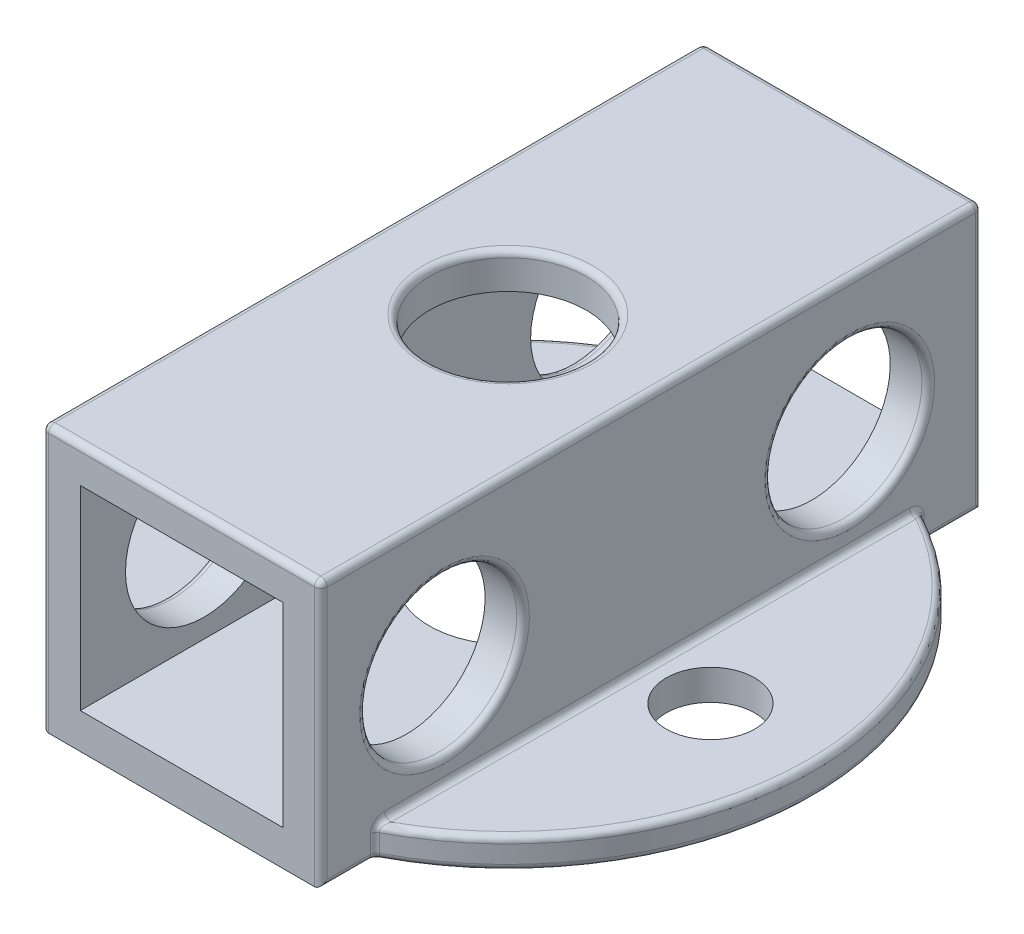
ISO-10303-21;
HEADER;
FILE_DESCRIPTION(('STEP AP214'),'2;1');
FILE_NAME('part.step','',(''),(''),'','','');
FILE_SCHEMA(('AUTOMOTIVE_DESIGN { 1 0 10303 214 1 1 1 1 }'));
ENDSEC;
DATA;
#1=APPLICATION_CONTEXT('core data for automotive mechanical design processes');
#2=APPLICATION_PROTOCOL_DEFINITION('international standard','automotive_design',2000,#1);
#3=PRODUCT_CONTEXT('',#1,'mechanical');
#4=PRODUCT('Part','Part','',(#3));
#5=PRODUCT_RELATED_PRODUCT_CATEGORY('part','',(#4));
#6=PRODUCT_DEFINITION_FORMATION('','',#4);
#7=PRODUCT_DEFINITION_CONTEXT('part definition',#1,'design');
#8=PRODUCT_DEFINITION('design','',#6,#7);
#9=PRODUCT_DEFINITION_SHAPE('','',#8);
#10=(LENGTH_UNIT() NAMED_UNIT(*) SI_UNIT(.MILLI.,.METRE.));
#11=(NAMED_UNIT(*) PLANE_ANGLE_UNIT() SI_UNIT($,.RADIAN.));
#12=(NAMED_UNIT(*) SI_UNIT($,.STERADIAN.) SOLID_ANGLE_UNIT());
#13=UNCERTAINTY_MEASURE_WITH_UNIT(LENGTH_MEASURE(1.E-05),#10,'distance_accuracy_value','');
#14=(GEOMETRIC_REPRESENTATION_CONTEXT(3) GLOBAL_UNCERTAINTY_ASSIGNED_CONTEXT((#13)) GLOBAL_UNIT_ASSIGNED_CONTEXT((#10,
#11,#12)) REPRESENTATION_CONTEXT('',''));
#15=CARTESIAN_POINT('',(0.,0.,0.));
#16=DIRECTION('',(0.,0.,1.));
#17=DIRECTION('',(1.,0.,0.));
#18=AXIS2_PLACEMENT_3D('',#15,#16,#17);
#19=CARTESIAN_POINT('',(5.5,10.5,12.8852301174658));
#20=DIRECTION('',(1.,0.,0.));
#21=DIRECTION('',(0.,0.,-1.));
#22=AXIS2_PLACEMENT_3D('',#19,#20,#21);
#23=PLANE('',#22);
#24=CARTESIAN_POINT('',(5.5,5.25,-8.));
#25=DIRECTION('',(1.,0.,0.));
#26=DIRECTION('',(0.,0.,-1.));
#27=AXIS2_PLACEMENT_3D('',#24,#25,#26);
#28=CIRCLE('',#27,3.35);
#29=CARTESIAN_POINT('',(5.5,5.25,-11.35));
#30=VERTEX_POINT('',#29);
#31=EDGE_CURVE('E572',#30,#30,#28,.F.);
#32=ORIENTED_EDGE('',*,*,#31,.T.);
#33=EDGE_LOOP('',(#32));
#34=FACE_BOUND('',#33,.T.);
#35=CARTESIAN_POINT('',(5.5,5.25,8.));
#36=DIRECTION('',(1.,0.,0.));
#37=DIRECTION('',(0.,0.,-1.));
#38=AXIS2_PLACEMENT_3D('',#35,#36,#37);
#39=CIRCLE('',#38,3.35);
#40=CARTESIAN_POINT('',(5.5,5.25,4.65));
#41=VERTEX_POINT('',#40);
#42=EDGE_CURVE('E576',#41,#41,#39,.F.);
#43=ORIENTED_EDGE('',*,*,#42,.T.);
#44=EDGE_LOOP('',(#43));
#45=FACE_BOUND('',#44,.T.);
#46=CARTESIAN_POINT('',(5.5,0.801848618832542,10.9043989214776));
#47=CARTESIAN_POINT('',(5.5,0.853094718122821,10.7582834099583));
#48=CARTESIAN_POINT('',(5.63862766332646,0.87592430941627,10.6931905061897));
#49=CARTESIAN_POINT('',(5.5,0.825603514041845,10.912765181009));
#50=CARTESIAN_POINT('',(5.5,0.868354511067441,10.7650331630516));
#51=CARTESIAN_POINT('',(5.63696926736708,0.887801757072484,10.6982478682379));
#52=CARTESIAN_POINT('',(5.5,0.8500706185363,10.9191116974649));
#53=CARTESIAN_POINT('',(5.5,0.884319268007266,10.7701699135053));
#54=CARTESIAN_POINT('',(5.6357126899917,0.90003530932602,10.7020829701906));
#55=CARTESIAN_POINT('',(5.5,0.899690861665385,10.9276141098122));
#56=CARTESIAN_POINT('',(5.5,0.916838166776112,10.7770487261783));
#57=CARTESIAN_POINT('',(5.63403023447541,0.924845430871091,10.7072199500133));
#58=CARTESIAN_POINT('',(5.5,0.924843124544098,10.9297751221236));
#59=CARTESIAN_POINT('',(5.5,0.93342707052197,10.7788105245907));
#60=CARTESIAN_POINT('',(5.63360334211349,0.937421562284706,10.7085249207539));
#61=CARTESIAN_POINT('',(5.5,0.975729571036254,10.929776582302));
#62=CARTESIAN_POINT('',(5.5,0.966950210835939,10.778813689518));
#63=CARTESIAN_POINT('',(5.63360313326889,0.962864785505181,10.7085257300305));
#64=CARTESIAN_POINT('',(5.5,1.00146396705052,10.9275175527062));
#65=CARTESIAN_POINT('',(5.5,0.98392452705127,10.7769739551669));
#66=CARTESIAN_POINT('',(5.6340494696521,0.975731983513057,10.7071614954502));
#67=CARTESIAN_POINT('',(5.5,1.05213169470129,10.9186251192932));
#68=CARTESIAN_POINT('',(5.5,1.01712008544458,10.7697715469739));
#69=CARTESIAN_POINT('',(5.63580882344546,1.00106584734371,10.7017891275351));
#70=CARTESIAN_POINT('',(5.5,1.07706522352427,10.9119928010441));
#71=CARTESIAN_POINT('',(5.5,1.03337935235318,10.764392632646));
#72=CARTESIAN_POINT('',(5.63712162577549,1.01353261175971,10.6977816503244));
#73=CARTESIAN_POINT('',(5.5,1.14948961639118,10.8859601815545));
#74=CARTESIAN_POINT('',(5.5,1.08008174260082,10.7433427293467));
#75=CARTESIAN_POINT('',(5.64228445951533,1.04974480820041,10.6820427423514));
#76=CARTESIAN_POINT('',(5.5,1.19488985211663,10.8604197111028));
#77=CARTESIAN_POINT('',(5.5,1.10859532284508,10.7226499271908));
#78=CARTESIAN_POINT('',(5.6473597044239,1.07244492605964,10.666592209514));
#79=CARTESIAN_POINT('',(5.5,1.27744576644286,10.7955626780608));
#80=CARTESIAN_POINT('',(5.5,1.15751983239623,10.6713156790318));
#81=CARTESIAN_POINT('',(5.66034287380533,1.11372288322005,10.6272693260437));
#82=CARTESIAN_POINT('',(5.5,1.31414161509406,10.7556808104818));
#83=CARTESIAN_POINT('',(5.5,1.17751124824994,10.6398826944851));
#84=CARTESIAN_POINT('',(5.6683673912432,1.13207080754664,10.6030510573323));
#85=CARTESIAN_POINT('',(5.5,1.37810964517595,10.6624594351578));
#86=CARTESIAN_POINT('',(5.5,1.20779704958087,10.5686090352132));
#87=CARTESIAN_POINT('',(5.68729982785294,1.16405482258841,10.5462775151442));
#88=CARTESIAN_POINT('',(5.5,1.40390837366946,10.6081240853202));
#89=CARTESIAN_POINT('',(5.5,1.21644763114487,10.527852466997));
#90=CARTESIAN_POINT('',(5.69842736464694,1.17695418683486,10.5130994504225));
#91=CARTESIAN_POINT('',(5.5,1.44118481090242,10.4878500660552));
#92=CARTESIAN_POINT('',(5.5,1.22010626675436,10.4421903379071));
#93=CARTESIAN_POINT('',(5.72334928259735,1.19559240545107,10.4393794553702));
#94=CARTESIAN_POINT('',(5.5,1.45063496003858,10.4212975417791));
#95=CARTESIAN_POINT('',(5.5,1.2126232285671,10.3972361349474));
#96=CARTESIAN_POINT('',(5.73730335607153,1.20031748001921,10.3984301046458));
#97=CARTESIAN_POINT('',(5.5,1.4492407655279,10.2827039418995));
#98=CARTESIAN_POINT('',(5.5,1.18238337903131,10.3114958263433));
#99=CARTESIAN_POINT('',(5.76671459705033,1.19962038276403,10.3128073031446));
#100=CARTESIAN_POINT('',(5.5,1.4366071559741,10.2106761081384));
#101=CARTESIAN_POINT('',(5.5,1.15731099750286,10.2718743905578));
#102=CARTESIAN_POINT('',(5.78219886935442,1.19330357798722,10.2681125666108));
#103=CARTESIAN_POINT('',(5.5,1.41219150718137,10.1427812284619));
#104=CARTESIAN_POINT('',(5.5,1.12754616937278,10.2449676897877));
#105=CARTESIAN_POINT('',(5.79703184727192,1.18109575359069,10.2257436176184));
#106=(BOUNDED_SURFACE() B_SPLINE_SURFACE(3,2,((#46,#47,#48),(#49,#50,#51),(#52,#53,#54),(#55,
#56,#57),(#58,#59,#60),(#61,#62,#63),(#64,#65,#66),(#67,#68,#69),(#70,#71,#72),(#73,#74,#75),
(#76,#77,#78),(#79,#80,#81),(#82,#83,#84),(#85,#86,#87),(#88,#89,#90),(#91,#92,#93),(#94,#95,
#96),(#97,#98,#99),(#100,#101,#102),(#103,#104,#105)),.UNSPECIFIED.,.F.,.F.,
.F.) B_SPLINE_SURFACE_WITH_KNOTS((4,2,2,2,2,2,2,2,2,4),(3,3),(0.,0.0754694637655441,
0.150846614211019,0.227939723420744,0.305013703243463,0.45834789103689,0.618543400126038,
0.796294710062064,0.994832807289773,1.21020998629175),(0.,1.),
.UNSPECIFIED.) GEOMETRIC_REPRESENTATION_ITEM() RATIONAL_B_SPLINE_SURFACE(((1.,0.850143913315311,
1.),(1.,0.852092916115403,1.),(1.,0.853565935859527,1.),(1.,0.855535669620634,1.),(1.,
0.856033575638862,1.),(1.,0.856033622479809,1.),(1.,0.855512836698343,1.),(1.,0.853453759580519,
1.),(1.,0.851915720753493,1.),(1.,0.845841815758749,1.),(1.,0.839845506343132,1.),(1.,
0.824242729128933,1.),(1.,0.81448672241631,1.),(1.,0.790920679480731,1.),(1.,0.776783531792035,
1.),(1.,0.74403690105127,1.),(1.,0.725097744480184,1.),(1.,0.683424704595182,1.),(1.,
0.660505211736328,1.),(1.,0.63713130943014,1.))) REPRESENTATION_ITEM('') SURFACE());
#107=CARTESIAN_POINT('',(5.5,1.41219150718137,10.1427812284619));
#108=CARTESIAN_POINT('',(5.5,1.4366071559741,10.2106761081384));
#109=CARTESIAN_POINT('',(5.5,1.4492407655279,10.2827039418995));
#110=CARTESIAN_POINT('',(5.5,1.45063496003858,10.4212975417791));
#111=CARTESIAN_POINT('',(5.5,1.44118481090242,10.4878500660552));
#112=CARTESIAN_POINT('',(5.5,1.40390837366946,10.6081240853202));
#113=CARTESIAN_POINT('',(5.5,1.37810964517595,10.6624594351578));
#114=CARTESIAN_POINT('',(5.5,1.31414161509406,10.7556808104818));
#115=CARTESIAN_POINT('',(5.5,1.27744576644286,10.7955626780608));
#116=CARTESIAN_POINT('',(5.5,1.19488985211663,10.8604197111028));
#117=CARTESIAN_POINT('',(5.5,1.14948961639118,10.8859601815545));
#118=CARTESIAN_POINT('',(5.5,1.07706522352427,10.9119928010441));
#119=CARTESIAN_POINT('',(5.5,1.05213169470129,10.9186251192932));
#120=CARTESIAN_POINT('',(5.5,1.00146396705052,10.9275175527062));
#121=CARTESIAN_POINT('',(5.5,0.975729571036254,10.929776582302));
#122=CARTESIAN_POINT('',(5.5,0.924843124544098,10.9297751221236));
#123=CARTESIAN_POINT('',(5.5,0.899690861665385,10.9276141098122));
#124=CARTESIAN_POINT('',(5.5,0.8500706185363,10.9191116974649));
#125=CARTESIAN_POINT('',(5.5,0.825603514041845,10.912765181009));
#126=CARTESIAN_POINT('',(5.5,0.801848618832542,10.9043989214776));
#127=B_SPLINE_CURVE_WITH_KNOTS('',3,(#107,#108,#109,#110,#111,#112,#113,#114,#115,#116,#117,
#118,#119,#120,#121,#122,#123,#124,#125,#126),.UNSPECIFIED.,.F.,.F.,(4,2,2,2,2,2,2,2,2,4),(0.,
0.215377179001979,0.413915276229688,0.591666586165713,0.751862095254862,0.905196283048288,
0.982270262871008,1.05936337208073,1.13474052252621,1.21020998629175),.UNSPECIFIED.);
#128=CARTESIAN_POINT('',(5.5,1.45,10.3614670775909));
#129=VERTEX_POINT('',#128);
#130=CARTESIAN_POINT('',(5.5,0.95,10.9297758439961));
#131=VERTEX_POINT('',#130);
#132=EDGE_CURVE('E578',#129,#131,#127,.T.);
#133=ORIENTED_EDGE('',*,*,#132,.F.);
#134=DIRECTION('',(0.,0.,-1.));
#135=VECTOR('',#134,1.);
#136=CARTESIAN_POINT('',(5.5,1.45,-10.777754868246));
#137=LINE('',#136,#135);
#138=CARTESIAN_POINT('',(5.5,1.45,-10.3614670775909));
#139=VERTEX_POINT('',#138);
#140=EDGE_CURVE('E343',#129,#139,#137,.T.);
#141=ORIENTED_EDGE('',*,*,#140,.T.);
#142=CARTESIAN_POINT('',(5.5,1.39999087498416,-10.1114670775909));
#143=CARTESIAN_POINT('',(5.5,1.11319358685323,-10.232224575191));
#144=CARTESIAN_POINT('',(5.80387241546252,1.17499543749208,-10.2062025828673));
#145=CARTESIAN_POINT('',(5.5,1.41659308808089,-10.1510377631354));
#146=CARTESIAN_POINT('',(5.5,1.13152421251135,-10.2470639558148));
#147=CARTESIAN_POINT('',(5.79520879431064,1.18329654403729,-10.2309157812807));
#148=CARTESIAN_POINT('',(5.5,1.42911437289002,-10.1921507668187));
#149=CARTESIAN_POINT('',(5.5,1.14886723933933,-10.2661206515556));
#150=CARTESIAN_POINT('',(5.78627722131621,1.18955718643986,-10.2565210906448));
#151=CARTESIAN_POINT('',(5.5,1.4458209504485,-10.2759599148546));
#152=CARTESIAN_POINT('',(5.5,1.17837951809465,-10.3099486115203));
#153=CARTESIAN_POINT('',(5.76821355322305,1.19791047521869,-10.3085742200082));
#154=CARTESIAN_POINT('',(5.5,1.45002198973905,-10.3186529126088));
#155=CARTESIAN_POINT('',(5.5,1.1907779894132,-10.3345147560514));
#156=CARTESIAN_POINT('',(5.75908187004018,1.20001099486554,-10.33502035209));
#157=CARTESIAN_POINT('',(5.5,1.44996342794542,-10.4326731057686));
#158=CARTESIAN_POINT('',(5.5,1.21461739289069,-10.4041879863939));
#159=CARTESIAN_POINT('',(5.73489556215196,1.19998171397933,-10.4054517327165));
#160=CARTESIAN_POINT('',(5.5,1.43824578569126,-10.5042142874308));
#161=CARTESIAN_POINT('',(5.5,1.22135899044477,-10.4532531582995));
#162=CARTESIAN_POINT('',(5.71992890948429,1.19412289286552,-10.4494380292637));
#163=CARTESIAN_POINT('',(5.5,1.40314483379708,-10.6052966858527));
#164=CARTESIAN_POINT('',(5.5,1.21520301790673,-10.5267251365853));
#165=CARTESIAN_POINT('',(5.69903689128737,1.17657241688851,-10.5113436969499));
#166=CARTESIAN_POINT('',(5.5,1.38842570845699,-10.6380754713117));
#167=CARTESIAN_POINT('',(5.5,1.21060938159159,-10.550974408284));
#168=CARTESIAN_POINT('',(5.6923079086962,1.16921285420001,-10.5313744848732));
#169=CARTESIAN_POINT('',(5.5,1.35322553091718,-10.7003556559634));
#170=CARTESIAN_POINT('',(5.5,1.19618841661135,-10.5977694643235));
#171=CARTESIAN_POINT('',(5.6795930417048,1.1516127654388,-10.5693668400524));
#172=CARTESIAN_POINT('',(5.5,1.33275950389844,-10.7298653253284));
#173=CARTESIAN_POINT('',(5.5,1.18645820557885,-10.6204175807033));
#174=CARTESIAN_POINT('',(5.67360527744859,1.14137975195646,-10.5873336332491));
#175=CARTESIAN_POINT('',(5.5,1.28832273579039,-10.7820235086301));
#176=CARTESIAN_POINT('',(5.5,1.16304184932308,-10.6608606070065));
#177=CARTESIAN_POINT('',(5.66307168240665,1.11916136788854,-10.6190433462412));
#178=CARTESIAN_POINT('',(5.5,1.26478147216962,-10.8050375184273));
#179=CARTESIAN_POINT('',(5.5,1.14979634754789,-10.6789748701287));
#180=CARTESIAN_POINT('',(5.65844757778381,1.10739073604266,-10.6330126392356));
#181=CARTESIAN_POINT('',(5.5,1.21372668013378,-10.8460225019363));
#182=CARTESIAN_POINT('',(5.5,1.11968391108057,-10.7113858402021));
#183=CARTESIAN_POINT('',(5.65024052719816,1.08186334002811,-10.6578643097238));
#184=CARTESIAN_POINT('',(5.5,1.18622553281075,-10.8640086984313));
#185=CARTESIAN_POINT('',(5.5,1.10282438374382,-10.7257882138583));
#186=CARTESIAN_POINT('',(5.64665443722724,1.06811276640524,-10.6687560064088));
#187=CARTESIAN_POINT('',(5.5,1.13183299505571,-10.8920199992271));
#188=CARTESIAN_POINT('',(5.5,1.06863312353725,-10.7482578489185));
#189=CARTESIAN_POINT('',(5.64108219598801,1.04091649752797,-10.6857068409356));
#190=CARTESIAN_POINT('',(5.5,1.10531397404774,-10.9027693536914));
#191=CARTESIAN_POINT('',(5.5,1.05162509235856,-10.7569481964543));
#192=CARTESIAN_POINT('',(5.63895002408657,1.02765698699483,-10.6922060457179));
#193=CARTESIAN_POINT('',(5.5,1.05072646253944,-10.91910992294));
#194=CARTESIAN_POINT('',(5.5,1.01624560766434,-10.7701488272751));
#195=CARTESIAN_POINT('',(5.63571227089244,1.00036323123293,-10.7020826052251));
#196=CARTESIAN_POINT('',(5.5,1.0226588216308,-10.9247039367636));
#197=CARTESIAN_POINT('',(5.5,0.997830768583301,-10.774698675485));
#198=CARTESIAN_POINT('',(5.63460613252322,0.986329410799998,-10.7054616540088));
#199=CARTESIAN_POINT('',(5.5,0.968825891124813,-10.9301140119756));
#200=CARTESIAN_POINT('',(5.5,0.962429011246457,-10.7790831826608));
#201=CARTESIAN_POINT('',(5.63353626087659,0.959412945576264,-10.708729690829));
#202=CARTESIAN_POINT('',(5.5,0.943111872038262,-10.9304530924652));
#203=CARTESIAN_POINT('',(5.5,0.9454445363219,-10.7793553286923));
#204=CARTESIAN_POINT('',(5.63346911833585,0.946555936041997,-10.708934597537));
#205=CARTESIAN_POINT('',(5.5,0.891953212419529,-10.926713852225));
#206=CARTESIAN_POINT('',(5.5,0.911770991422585,-10.7763329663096));
#207=CARTESIAN_POINT('',(5.63420881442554,0.920976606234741,-10.7066756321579));
#208=CARTESIAN_POINT('',(5.5,0.866509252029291,-10.9226262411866));
#209=CARTESIAN_POINT('',(5.5,0.895042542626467,-10.7730237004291));
#210=CARTESIAN_POINT('',(5.63501749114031,0.90825462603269,-10.7042061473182));
#211=CARTESIAN_POINT('',(5.5,0.841609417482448,-10.9163391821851));
#212=CARTESIAN_POINT('',(5.5,0.878858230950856,-10.7679278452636));
#213=CARTESIAN_POINT('',(5.63626162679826,0.895804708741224,-10.700407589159));
#214=(BOUNDED_SURFACE() B_SPLINE_SURFACE(3,2,((#142,#143,#144),(#145,#146,#147),(#148,#149,
#150),(#151,#152,#153),(#154,#155,#156),(#157,#158,#159),(#160,#161,#162),(#163,#164,#165),
(#166,#167,#168),(#169,#170,#171),(#172,#173,#174),(#175,#176,#177),(#178,#179,#180),(#181,#182,
#183),(#184,#185,#186),(#187,#188,#189),(#190,#191,#192),(#193,#194,#195),(#196,#197,#198),
(#199,#200,#201),(#202,#203,#204),(#205,#206,#207),(#208,#209,#210),(#211,#212,#213)),
.UNSPECIFIED.,.F.,.F.,.F.) B_SPLINE_SURFACE_WITH_KNOTS((4,2,2,2,2,2,2,2,2,2,2,4),(3,3),(0.,
0.128229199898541,0.256215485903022,0.469074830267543,0.576399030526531,0.683445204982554,
0.781643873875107,0.879541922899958,0.964911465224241,1.05023462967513,1.12700415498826,
1.20393510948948),(0.,1.),
.UNSPECIFIED.) GEOMETRIC_REPRESENTATION_ITEM() RATIONAL_B_SPLINE_SURFACE(((1.,0.626302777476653,
1.),(1.,0.640150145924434,1.),(1.,0.653936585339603,1.),(1.,0.680992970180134,1.),(1.,
0.694263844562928,1.),(1.,0.728466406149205,1.),(1.,0.748642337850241,1.),(1.,0.775894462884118,
1.),(1.,0.784505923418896,1.),(1.,0.800548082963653,1.),(1.,0.807981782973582,1.),(1.,
0.820911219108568,1.),(1.,0.826516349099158,1.),(1.,0.836387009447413,1.),(1.,0.840656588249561,
1.),(1.,0.847257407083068,1.),(1.,0.849766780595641,1.),(1.,0.85356842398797,1.),(1.,
0.854861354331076,1.),(1.,0.8561121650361,1.),(1.,0.856190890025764,1.),(1.,0.855325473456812,
1.),(1.,0.854379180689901,1.),(1.,0.85292247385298,1.))) REPRESENTATION_ITEM('') SURFACE());
#215=CARTESIAN_POINT('',(5.5,0.841609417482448,-10.9163391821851));
#216=CARTESIAN_POINT('',(5.5,0.866509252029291,-10.9226262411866));
#217=CARTESIAN_POINT('',(5.5,0.891953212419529,-10.926713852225));
#218=CARTESIAN_POINT('',(5.5,0.943111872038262,-10.9304530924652));
#219=CARTESIAN_POINT('',(5.5,0.968825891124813,-10.9301140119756));
#220=CARTESIAN_POINT('',(5.5,1.0226588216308,-10.9247039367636));
#221=CARTESIAN_POINT('',(5.5,1.05072646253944,-10.91910992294));
#222=CARTESIAN_POINT('',(5.5,1.10531397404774,-10.9027693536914));
#223=CARTESIAN_POINT('',(5.5,1.13183299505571,-10.8920199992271));
#224=CARTESIAN_POINT('',(5.5,1.18622553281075,-10.8640086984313));
#225=CARTESIAN_POINT('',(5.5,1.21372668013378,-10.8460225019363));
#226=CARTESIAN_POINT('',(5.5,1.26478147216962,-10.8050375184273));
#227=CARTESIAN_POINT('',(5.5,1.28832273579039,-10.7820235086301));
#228=CARTESIAN_POINT('',(5.5,1.33275950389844,-10.7298653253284));
#229=CARTESIAN_POINT('',(5.5,1.35322553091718,-10.7003556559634));
#230=CARTESIAN_POINT('',(5.5,1.38842570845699,-10.6380754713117));
#231=CARTESIAN_POINT('',(5.5,1.40314483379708,-10.6052966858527));
#232=CARTESIAN_POINT('',(5.5,1.43824578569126,-10.5042142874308));
#233=CARTESIAN_POINT('',(5.5,1.44996342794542,-10.4326731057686));
#234=CARTESIAN_POINT('',(5.5,1.45002198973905,-10.3186529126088));
#235=CARTESIAN_POINT('',(5.5,1.4458209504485,-10.2759599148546));
#236=CARTESIAN_POINT('',(5.5,1.42911437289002,-10.1921507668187));
#237=CARTESIAN_POINT('',(5.5,1.41659308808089,-10.1510377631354));
#238=CARTESIAN_POINT('',(5.5,1.39999087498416,-10.1114670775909));
#239=B_SPLINE_CURVE_WITH_KNOTS('',3,(#215,#216,#217,#218,#219,#220,#221,#222,#223,#224,#225,
#226,#227,#228,#229,#230,#231,#232,#233,#234,#235,#236,#237,#238),.UNSPECIFIED.,.F.,.F.,(4,2,2,
2,2,2,2,2,2,2,2,4),(0.,0.0769309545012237,0.15370047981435,0.239023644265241,0.324393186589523,
0.422291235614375,0.520489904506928,0.62753607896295,0.734860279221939,0.94771962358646,
1.07570590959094,1.20393510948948),.UNSPECIFIED.);
#240=CARTESIAN_POINT('',(5.5,0.95,-10.9297758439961));
#241=VERTEX_POINT('',#240);
#242=EDGE_CURVE('E335',#241,#139,#239,.T.);
#243=ORIENTED_EDGE('',*,*,#242,.F.);
#244=DIRECTION('',(0.,-1.,0.));
#245=VECTOR('',#244,1.);
#246=CARTESIAN_POINT('',(5.5,10.5,-10.9297758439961));
#247=LINE('',#246,#245);
#248=CARTESIAN_POINT('',(5.5,0.25,-10.9297758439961));
#249=VERTEX_POINT('',#248);
#250=EDGE_CURVE('E333',#241,#249,#247,.T.);
#251=ORIENTED_EDGE('',*,*,#250,.T.);
#252=DIRECTION('',(0.,0.,1.));
#253=VECTOR('',#252,1.);
#254=CARTESIAN_POINT('',(5.5,0.25,-13.21143847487));
#255=LINE('',#254,#253);
#256=CARTESIAN_POINT('',(5.5,0.25,-12.96143847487));
#257=VERTEX_POINT('',#256);
#258=EDGE_CURVE('E328',#249,#257,#255,.F.);
#259=ORIENTED_EDGE('',*,*,#258,.T.);
#260=DIRECTION('',(0.,-1.,0.));
#261=VECTOR('',#260,1.);
#262=CARTESIAN_POINT('',(5.5,10.5,-12.96143847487));
#263=LINE('',#262,#261);
#264=CARTESIAN_POINT('',(5.5,10.25,-12.96143847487));
#265=VERTEX_POINT('',#264);
#266=EDGE_CURVE('E322',#257,#265,#263,.F.);
#267=ORIENTED_EDGE('',*,*,#266,.T.);
#268=DIRECTION('',(0.,0.,1.));
#269=VECTOR('',#268,1.);
#270=CARTESIAN_POINT('',(5.5,10.25,12.8852301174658));
#271=LINE('',#270,#269);
#272=CARTESIAN_POINT('',(5.5,10.25,12.6352301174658));
#273=VERTEX_POINT('',#272);
#274=EDGE_CURVE('E320',#265,#273,#271,.T.);
#275=ORIENTED_EDGE('',*,*,#274,.T.);
#276=DIRECTION('',(0.,-1.,0.));
#277=VECTOR('',#276,1.);
#278=CARTESIAN_POINT('',(5.5,10.5,12.6352301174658));
#279=LINE('',#278,#277);
#280=CARTESIAN_POINT('',(5.5,0.25,12.6352301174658));
#281=VERTEX_POINT('',#280);
#282=EDGE_CURVE('E324',#273,#281,#279,.T.);
#283=ORIENTED_EDGE('',*,*,#282,.T.);
#284=DIRECTION('',(0.,0.,1.));
#285=VECTOR('',#284,1.);
#286=CARTESIAN_POINT('',(5.5,0.25,10.777754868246));
#287=LINE('',#286,#285);
#288=CARTESIAN_POINT('',(5.5,0.25,10.9297758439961));
#289=VERTEX_POINT('',#288);
#290=EDGE_CURVE('E326',#281,#289,#287,.F.);
#291=ORIENTED_EDGE('',*,*,#290,.T.);
#292=DIRECTION('',(0.,-1.,0.));
#293=VECTOR('',#292,1.);
#294=CARTESIAN_POINT('',(5.5,10.5,10.9297758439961));
#295=LINE('',#294,#293);
#296=EDGE_CURVE('E331',#289,#131,#295,.F.);
#297=ORIENTED_EDGE('',*,*,#296,.T.);
#298=EDGE_LOOP('',(#133,#141,#243,#251,#259,#267,#275,#283,#291,#297));
#299=FACE_BOUND('',#298,.T.);
#300=ADVANCED_FACE('F35',(#34,#45,#299),#23,.T.);
#301=CARTESIAN_POINT('',(0.,0.25,-6.57043182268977));
#302=DIRECTION('',(0.,-1.,0.));
#303=DIRECTION('',(0.,0.,-1.));
#304=AXIS2_PLACEMENT_3D('',#301,#302,#303);
#305=PLANE('',#304);
#306=CARTESIAN_POINT('',(0.,0.25,-6.57043182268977));
#307=DIRECTION('',(0.,-1.,0.));
#308=DIRECTION('',(0.,0.,-1.));
#309=AXIS2_PLACEMENT_3D('',#306,#307,#308);
#310=CIRCLE('',#309,2.5);
#311=CARTESIAN_POINT('',(0.,0.25,-9.07043182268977));
#312=VERTEX_POINT('',#311);
#313=EDGE_CURVE('E1413',#312,#312,#310,.T.);
#314=ORIENTED_EDGE('',*,*,#313,.T.);
#315=EDGE_LOOP('',(#314));
#316=FACE_BOUND('',#315,.T.);
#317=CARTESIAN_POINT('',(0.,0.25,-6.57043182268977));
#318=DIRECTION('',(0.,-1.,0.));
#319=DIRECTION('',(0.,0.,-1.));
#320=AXIS2_PLACEMENT_3D('',#317,#318,#319);
#321=CIRCLE('',#320,1.6);
#322=CARTESIAN_POINT('',(0.,0.25,-8.17043182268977));
#323=VERTEX_POINT('',#322);
#324=EDGE_CURVE('E1409',#323,#323,#321,.T.);
#325=ORIENTED_EDGE('',*,*,#324,.F.);
#326=EDGE_LOOP('',(#325));
#327=FACE_BOUND('',#326,.T.);
#328=ADVANCED_FACE('F561',(#316,#327),#305,.T.);
#329=CARTESIAN_POINT('',(0.,0.25,8.3046190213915));
#330=DIRECTION('',(0.,-1.,0.));
#331=DIRECTION('',(0.,0.,-1.));
#332=AXIS2_PLACEMENT_3D('',#329,#330,#331);
#333=PLANE('',#332);
#334=CARTESIAN_POINT('',(0.,0.25,8.3046190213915));
#335=DIRECTION('',(0.,-1.,0.));
#336=DIRECTION('',(0.,0.,-1.));
#337=AXIS2_PLACEMENT_3D('',#334,#335,#336);
#338=CIRCLE('',#337,2.5);
#339=CARTESIAN_POINT('',(0.,0.25,5.8046190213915));
#340=VERTEX_POINT('',#339);
#341=EDGE_CURVE('E307',#340,#340,#338,.T.);
#342=ORIENTED_EDGE('',*,*,#341,.T.);
#343=EDGE_LOOP('',(#342));
#344=FACE_BOUND('',#343,.T.);
#345=CARTESIAN_POINT('',(0.,0.25,8.3046190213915));
#346=DIRECTION('',(0.,-1.,0.));
#347=DIRECTION('',(0.,0.,-1.));
#348=AXIS2_PLACEMENT_3D('',#345,#346,#347);
#349=CIRCLE('',#348,1.6);
#350=CARTESIAN_POINT('',(0.,0.25,6.7046190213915));
#351=VERTEX_POINT('',#350);
#352=EDGE_CURVE('E1400',#351,#351,#349,.T.);
#353=ORIENTED_EDGE('',*,*,#352,.F.);
#354=EDGE_LOOP('',(#353));
#355=FACE_BOUND('',#354,.T.);
#356=ADVANCED_FACE('F566',(#344,#355),#333,.T.);
#357=CARTESIAN_POINT('',(0.,1.2,0.));
#358=DIRECTION('',(0.,-1.,0.));
#359=DIRECTION('',(0.,0.,-1.));
#360=AXIS2_PLACEMENT_3D('',#357,#358,#359);
#361=CYLINDRICAL_SURFACE('',#360,12.1);
#362=CARTESIAN_POINT('',(0.,0.25,0.));
#363=DIRECTION('',(0.,1.,0.));
#364=DIRECTION('',(0.,0.,1.));
#365=AXIS2_PLACEMENT_3D('',#362,#363,#364);
#366=CIRCLE('',#365,12.1);
#367=CARTESIAN_POINT('',(-5.63360323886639,0.25,-10.7085253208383));
#368=VERTEX_POINT('',#367);
#369=CARTESIAN_POINT('',(-5.6336032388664,0.25,10.7085253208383));
#370=VERTEX_POINT('',#369);
#371=EDGE_CURVE('E44',#368,#370,#366,.T.);
#372=ORIENTED_EDGE('',*,*,#371,.T.);
#373=DIRECTION('',(0.,-1.,0.));
#374=VECTOR('',#373,1.);
#375=CARTESIAN_POINT('',(-5.6336032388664,1.2,10.7085253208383));
#376=LINE('',#375,#374);
#377=CARTESIAN_POINT('',(-5.6336032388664,0.95,10.7085253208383));
#378=VERTEX_POINT('',#377);
#379=EDGE_CURVE('E11',#370,#378,#376,.F.);
#380=ORIENTED_EDGE('',*,*,#379,.T.);
#381=CARTESIAN_POINT('',(0.,0.95,0.));
#382=DIRECTION('',(0.,1.,0.));
#383=DIRECTION('',(0.,0.,1.));
#384=AXIS2_PLACEMENT_3D('',#381,#382,#383);
#385=CIRCLE('',#384,12.1);
#386=CARTESIAN_POINT('',(-5.63360323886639,0.95,-10.7085253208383));
#387=VERTEX_POINT('',#386);
#388=EDGE_CURVE('E762',#378,#387,#385,.F.);
#389=ORIENTED_EDGE('',*,*,#388,.T.);
#390=DIRECTION('',(0.,-1.,0.));
#391=VECTOR('',#390,1.);
#392=CARTESIAN_POINT('',(-5.63360323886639,1.2,-10.7085253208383));
#393=LINE('',#392,#391);
#394=EDGE_CURVE('E55',#387,#368,#393,.T.);
#395=ORIENTED_EDGE('',*,*,#394,.T.);
#396=EDGE_LOOP('',(#372,#380,#389,#395));
#397=FACE_BOUND('',#396,.T.);
#398=ADVANCED_FACE('F808',(#397),#361,.T.);
#399=CARTESIAN_POINT('',(0.,1.2,0.));
#400=DIRECTION('',(0.,1.,0.));
#401=DIRECTION('',(0.,0.,1.));
#402=AXIS2_PLACEMENT_3D('',#399,#400,#401);
#403=PLANE('',#402);
#404=CARTESIAN_POINT('',(0.,1.2,0.));
#405=DIRECTION('',(0.,1.,0.));
#406=DIRECTION('',(0.,0.,1.));
#407=AXIS2_PLACEMENT_3D('',#404,#405,#406);
#408=CIRCLE('',#407,11.85);
#409=CARTESIAN_POINT('',(-5.75,1.2,-10.3614670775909));
#410=VERTEX_POINT('',#409);
#411=CARTESIAN_POINT('',(-5.75,1.2,10.3614670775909));
#412=VERTEX_POINT('',#411);
#413=EDGE_CURVE('E747',#410,#412,#408,.T.);
#414=ORIENTED_EDGE('',*,*,#413,.T.);
#415=DIRECTION('',(0.,0.,1.));
#416=VECTOR('',#415,1.);
#417=CARTESIAN_POINT('',(-5.75,1.2,-10.777754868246));
#418=LINE('',#417,#416);
#419=EDGE_CURVE('E749',#412,#410,#418,.F.);
#420=ORIENTED_EDGE('',*,*,#419,.T.);
#421=EDGE_LOOP('',(#414,#420));
#422=FACE_BOUND('',#421,.T.);
#423=CARTESIAN_POINT('',(-8.,1.2,0.));
#424=DIRECTION('',(0.,-1.,0.));
#425=DIRECTION('',(0.,0.,-1.));
#426=AXIS2_PLACEMENT_3D('',#423,#424,#425);
#427=CIRCLE('',#426,1.75);
#428=CARTESIAN_POINT('',(-8.,1.2,-1.75));
#429=VERTEX_POINT('',#428);
#430=EDGE_CURVE('E283',#429,#429,#427,.T.);
#431=ORIENTED_EDGE('',*,*,#430,.T.);
#432=EDGE_LOOP('',(#431));
#433=FACE_BOUND('',#432,.T.);
#434=ADVANCED_FACE('F1261',(#422,#433),#403,.T.);
#435=CARTESIAN_POINT('',(0.,0.25,0.));
#436=DIRECTION('',(0.,1.,0.));
#437=DIRECTION('',(0.,0.,1.));
#438=AXIS2_PLACEMENT_3D('',#435,#436,#437);
#439=CIRCLE('',#438,12.1);
#440=CARTESIAN_POINT('',(5.63360323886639,0.25,10.7085253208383));
#441=VERTEX_POINT('',#440);
#442=CARTESIAN_POINT('',(5.6336032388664,0.25,-10.7085253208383));
#443=VERTEX_POINT('',#442);
#444=EDGE_CURVE('E1465',#441,#443,#439,.T.);
#445=ORIENTED_EDGE('',*,*,#444,.T.);
#446=DIRECTION('',(0.,-1.,0.));
#447=VECTOR('',#446,1.);
#448=CARTESIAN_POINT('',(5.6336032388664,1.2,-10.7085253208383));
#449=LINE('',#448,#447);
#450=CARTESIAN_POINT('',(5.6336032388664,0.95,-10.7085253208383));
#451=VERTEX_POINT('',#450);
#452=EDGE_CURVE('E609',#443,#451,#449,.F.);
#453=ORIENTED_EDGE('',*,*,#452,.T.);
#454=CARTESIAN_POINT('',(0.,0.95,0.));
#455=DIRECTION('',(0.,1.,0.));
#456=DIRECTION('',(0.,0.,1.));
#457=AXIS2_PLACEMENT_3D('',#454,#455,#456);
#458=CIRCLE('',#457,12.1);
#459=CARTESIAN_POINT('',(5.63360323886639,0.95,10.7085253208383));
#460=VERTEX_POINT('',#459);
#461=EDGE_CURVE('E1478',#451,#460,#458,.F.);
#462=ORIENTED_EDGE('',*,*,#461,.T.);
#463=DIRECTION('',(0.,-1.,0.));
#464=VECTOR('',#463,1.);
#465=CARTESIAN_POINT('',(5.63360323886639,1.2,10.7085253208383));
#466=LINE('',#465,#464);
#467=EDGE_CURVE('E1477',#460,#441,#466,.T.);
#468=ORIENTED_EDGE('',*,*,#467,.T.);
#469=EDGE_LOOP('',(#445,#453,#462,#468));
#470=FACE_BOUND('',#469,.T.);
#471=ADVANCED_FACE('F352',(#470),#361,.T.);
#472=CARTESIAN_POINT('',(0.,1.2,0.));
#473=DIRECTION('',(0.,1.,0.));
#474=DIRECTION('',(0.,0.,1.));
#475=AXIS2_PLACEMENT_3D('',#472,#473,#474);
#476=CIRCLE('',#475,11.85);
#477=CARTESIAN_POINT('',(5.75,1.2,10.3614670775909));
#478=VERTEX_POINT('',#477);
#479=CARTESIAN_POINT('',(5.75,1.2,-10.3614670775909));
#480=VERTEX_POINT('',#479);
#481=EDGE_CURVE('E586',#478,#480,#476,.T.);
#482=ORIENTED_EDGE('',*,*,#481,.T.);
#483=DIRECTION('',(0.,0.,-1.));
#484=VECTOR('',#483,1.);
#485=CARTESIAN_POINT('',(5.75,1.2,10.777754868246));
#486=LINE('',#485,#484);
#487=EDGE_CURVE('E594',#480,#478,#486,.F.);
#488=ORIENTED_EDGE('',*,*,#487,.T.);
#489=EDGE_LOOP('',(#482,#488));
#490=FACE_BOUND('',#489,.T.);
#491=CARTESIAN_POINT('',(8.,1.2,0.));
#492=DIRECTION('',(0.,-1.,0.));
#493=DIRECTION('',(0.,0.,-1.));
#494=AXIS2_PLACEMENT_3D('',#491,#492,#493);
#495=CIRCLE('',#494,1.75);
#496=CARTESIAN_POINT('',(8.,1.2,-1.75));
#497=VERTEX_POINT('',#496);
#498=EDGE_CURVE('E289',#497,#497,#495,.T.);
#499=ORIENTED_EDGE('',*,*,#498,.T.);
#500=EDGE_LOOP('',(#499));
#501=FACE_BOUND('',#500,.T.);
#502=ADVANCED_FACE('F1253',(#490,#501),#403,.T.);
#503=CARTESIAN_POINT('',(0.,0.,0.));
#504=DIRECTION('',(0.,1.,0.));
#505=DIRECTION('',(0.,0.,1.));
#506=AXIS2_PLACEMENT_3D('',#503,#504,#505);
#507=PLANE('',#506);
#508=DIRECTION('',(-1.,0.,0.));
#509=VECTOR('',#508,1.);
#510=CARTESIAN_POINT('',(-5.5,0.,12.8852301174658));
#511=LINE('',#510,#509);
#512=CARTESIAN_POINT('',(5.25,0.,12.8852301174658));
#513=VERTEX_POINT('',#512);
#514=CARTESIAN_POINT('',(-5.25,0.,12.8852301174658));
#515=VERTEX_POINT('',#514);
#516=EDGE_CURVE('E279',#513,#515,#511,.T.);
#517=ORIENTED_EDGE('',*,*,#516,.T.);
#518=DIRECTION('',(0.,0.,-1.));
#519=VECTOR('',#518,1.);
#520=CARTESIAN_POINT('',(-5.25,0.,10.777754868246));
#521=LINE('',#520,#519);
#522=CARTESIAN_POINT('',(-5.25,0.,10.9297758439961));
#523=VERTEX_POINT('',#522);
#524=EDGE_CURVE('E714',#515,#523,#521,.T.);
#525=ORIENTED_EDGE('',*,*,#524,.T.);
#526=CARTESIAN_POINT('',(-5.75,0.,10.9297758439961));
#527=DIRECTION('',(0.,1.,0.));
#528=DIRECTION('',(0.,0.,1.));
#529=AXIS2_PLACEMENT_3D('',#526,#527,#528);
#530=CIRCLE('',#529,0.5);
#531=CARTESIAN_POINT('',(-5.51720647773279,0.,10.4872747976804));
#532=VERTEX_POINT('',#531);
#533=EDGE_CURVE('E711',#532,#523,#530,.F.);
#534=ORIENTED_EDGE('',*,*,#533,.F.);
#535=CARTESIAN_POINT('',(0.,0.,0.));
#536=DIRECTION('',(0.,1.,0.));
#537=DIRECTION('',(0.,0.,1.));
#538=AXIS2_PLACEMENT_3D('',#535,#536,#537);
#539=CIRCLE('',#538,11.85);
#540=CARTESIAN_POINT('',(-5.51720647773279,0.,-10.4872747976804));
#541=VERTEX_POINT('',#540);
#542=EDGE_CURVE('E707',#532,#541,#539,.F.);
#543=ORIENTED_EDGE('',*,*,#542,.T.);
#544=CARTESIAN_POINT('',(-5.75,0.,-10.9297758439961));
#545=DIRECTION('',(0.,1.,0.));
#546=DIRECTION('',(0.,0.,1.));
#547=AXIS2_PLACEMENT_3D('',#544,#545,#546);
#548=CIRCLE('',#547,0.5);
#549=CARTESIAN_POINT('',(-5.25,0.,-10.9297758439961));
#550=VERTEX_POINT('',#549);
#551=EDGE_CURVE('E704',#550,#541,#548,.F.);
#552=ORIENTED_EDGE('',*,*,#551,.F.);
#553=DIRECTION('',(0.,0.,-1.));
#554=VECTOR('',#553,1.);
#555=CARTESIAN_POINT('',(-5.25,0.,-13.21143847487));
#556=LINE('',#555,#554);
#557=CARTESIAN_POINT('',(-5.25,0.,-13.21143847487));
#558=VERTEX_POINT('',#557);
#559=EDGE_CURVE('E709',#550,#558,#556,.T.);
#560=ORIENTED_EDGE('',*,*,#559,.T.);
#561=DIRECTION('',(1.,0.,0.));
#562=VECTOR('',#561,1.);
#563=CARTESIAN_POINT('',(-5.5,0.,-13.21143847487));
#564=LINE('',#563,#562);
#565=CARTESIAN_POINT('',(5.25,0.,-13.21143847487));
#566=VERTEX_POINT('',#565);
#567=EDGE_CURVE('E274',#558,#566,#564,.T.);
#568=ORIENTED_EDGE('',*,*,#567,.T.);
#569=DIRECTION('',(0.,0.,1.));
#570=VECTOR('',#569,1.);
#571=CARTESIAN_POINT('',(5.25,0.,-10.777754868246));
#572=LINE('',#571,#570);
#573=CARTESIAN_POINT('',(5.25,0.,-10.9297758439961));
#574=VERTEX_POINT('',#573);
#575=EDGE_CURVE('E317',#566,#574,#572,.T.);
#576=ORIENTED_EDGE('',*,*,#575,.T.);
#577=CARTESIAN_POINT('',(5.75,0.,-10.9297758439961));
#578=DIRECTION('',(0.,1.,0.));
#579=DIRECTION('',(0.,0.,1.));
#580=AXIS2_PLACEMENT_3D('',#577,#578,#579);
#581=CIRCLE('',#580,0.5);
#582=CARTESIAN_POINT('',(5.51720647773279,0.,-10.4872747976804));
#583=VERTEX_POINT('',#582);
#584=EDGE_CURVE('E314',#583,#574,#581,.F.);
#585=ORIENTED_EDGE('',*,*,#584,.F.);
#586=CARTESIAN_POINT('',(0.,0.,0.));
#587=DIRECTION('',(0.,1.,0.));
#588=DIRECTION('',(0.,0.,1.));
#589=AXIS2_PLACEMENT_3D('',#586,#587,#588);
#590=CIRCLE('',#589,11.85);
#591=CARTESIAN_POINT('',(5.51720647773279,0.,10.4872747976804));
#592=VERTEX_POINT('',#591);
#593=EDGE_CURVE('E310',#583,#592,#590,.F.);
#594=ORIENTED_EDGE('',*,*,#593,.T.);
#595=CARTESIAN_POINT('',(5.75,0.,10.9297758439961));
#596=DIRECTION('',(0.,1.,0.));
#597=DIRECTION('',(0.,0.,1.));
#598=AXIS2_PLACEMENT_3D('',#595,#596,#597);
#599=CIRCLE('',#598,0.5);
#600=CARTESIAN_POINT('',(5.25,0.,10.9297758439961));
#601=VERTEX_POINT('',#600);
#602=EDGE_CURVE('E292',#601,#592,#599,.F.);
#603=ORIENTED_EDGE('',*,*,#602,.F.);
#604=DIRECTION('',(0.,0.,1.));
#605=VECTOR('',#604,1.);
#606=CARTESIAN_POINT('',(5.25,0.,12.8852301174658));
#607=LINE('',#606,#605);
#608=EDGE_CURVE('E312',#601,#513,#607,.T.);
#609=ORIENTED_EDGE('',*,*,#608,.T.);
#610=EDGE_LOOP('',(#517,#525,#534,#543,#552,#560,#568,#576,#585,#594,#603,#609));
#611=FACE_BOUND('',#610,.T.);
#612=CARTESIAN_POINT('',(0.,0.,-6.57043182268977));
#613=DIRECTION('',(0.,-1.,0.));
#614=DIRECTION('',(0.,0.,-1.));
#615=AXIS2_PLACEMENT_3D('',#612,#613,#614);
#616=CIRCLE('',#615,2.5);
#617=CARTESIAN_POINT('',(0.,0.,-9.07043182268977));
#618=VERTEX_POINT('',#617);
#619=EDGE_CURVE('E1406',#618,#618,#616,.T.);
#620=ORIENTED_EDGE('',*,*,#619,.F.);
#621=EDGE_LOOP('',(#620));
#622=FACE_BOUND('',#621,.T.);
#623=CARTESIAN_POINT('',(0.,0.,8.3046190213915));
#624=DIRECTION('',(0.,-1.,0.));
#625=DIRECTION('',(0.,0.,-1.));
#626=AXIS2_PLACEMENT_3D('',#623,#624,#625);
#627=CIRCLE('',#626,2.5);
#628=CARTESIAN_POINT('',(0.,0.,5.8046190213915));
#629=VERTEX_POINT('',#628);
#630=EDGE_CURVE('E1416',#629,#629,#627,.T.);
#631=ORIENTED_EDGE('',*,*,#630,.F.);
#632=EDGE_LOOP('',(#631));
#633=FACE_BOUND('',#632,.T.);
#634=CARTESIAN_POINT('',(0.,0.,0.));
#635=DIRECTION('',(0.,-1.,0.));
#636=DIRECTION('',(0.,0.,-1.));
#637=AXIS2_PLACEMENT_3D('',#634,#635,#636);
#638=CIRCLE('',#637,3.1);
#639=CARTESIAN_POINT('',(0.,0.,-3.1));
#640=VERTEX_POINT('',#639);
#641=EDGE_CURVE('E298',#640,#640,#638,.T.);
#642=ORIENTED_EDGE('',*,*,#641,.F.);
#643=EDGE_LOOP('',(#642));
#644=FACE_BOUND('',#643,.T.);
#645=CARTESIAN_POINT('',(8.,0.,0.));
#646=DIRECTION('',(0.,-1.,0.));
#647=DIRECTION('',(0.,0.,-1.));
#648=AXIS2_PLACEMENT_3D('',#645,#646,#647);
#649=CIRCLE('',#648,1.75);
#650=CARTESIAN_POINT('',(8.,0.,-1.75));
#651=VERTEX_POINT('',#650);
#652=EDGE_CURVE('E286',#651,#651,#649,.T.);
#653=ORIENTED_EDGE('',*,*,#652,.F.);
#654=EDGE_LOOP('',(#653));
#655=FACE_BOUND('',#654,.T.);
#656=CARTESIAN_POINT('',(-8.,0.,0.));
#657=DIRECTION('',(0.,-1.,0.));
#658=DIRECTION('',(0.,0.,-1.));
#659=AXIS2_PLACEMENT_3D('',#656,#657,#658);
#660=CIRCLE('',#659,1.75);
#661=CARTESIAN_POINT('',(-8.,0.,-1.75));
#662=VERTEX_POINT('',#661);
#663=EDGE_CURVE('E282',#662,#662,#660,.T.);
#664=ORIENTED_EDGE('',*,*,#663,.F.);
#665=EDGE_LOOP('',(#664));
#666=FACE_BOUND('',#665,.T.);
#667=ADVANCED_FACE('F824',(#611,#622,#633,#644,#655,#666),#507,.F.);
#668=CARTESIAN_POINT('',(8.,1.2,0.));
#669=DIRECTION('',(0.,-1.,0.));
#670=DIRECTION('',(0.,0.,-1.));
#671=AXIS2_PLACEMENT_3D('',#668,#669,#670);
#672=CYLINDRICAL_SURFACE('',#671,1.75);
#673=ORIENTED_EDGE('',*,*,#498,.F.);
#674=EDGE_LOOP('',(#673));
#675=FACE_BOUND('',#674,.T.);
#676=ORIENTED_EDGE('',*,*,#652,.T.);
#677=EDGE_LOOP('',(#676));
#678=FACE_BOUND('',#677,.T.);
#679=ADVANCED_FACE('F1240',(#675,#678),#672,.F.);
#680=CARTESIAN_POINT('',(-8.,1.2,0.));
#681=DIRECTION('',(0.,-1.,0.));
#682=DIRECTION('',(0.,0.,-1.));
#683=AXIS2_PLACEMENT_3D('',#680,#681,#682);
#684=CYLINDRICAL_SURFACE('',#683,1.75);
#685=ORIENTED_EDGE('',*,*,#430,.F.);
#686=EDGE_LOOP('',(#685));
#687=FACE_BOUND('',#686,.T.);
#688=ORIENTED_EDGE('',*,*,#663,.T.);
#689=EDGE_LOOP('',(#688));
#690=FACE_BOUND('',#689,.T.);
#691=ADVANCED_FACE('F1233',(#687,#690),#684,.F.);
#692=CARTESIAN_POINT('',(-5.5,10.5,12.8852301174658));
#693=DIRECTION('',(-1.,0.,0.));
#694=DIRECTION('',(0.,0.,1.));
#695=AXIS2_PLACEMENT_3D('',#692,#693,#694);
#696=PLANE('',#695);
#697=CARTESIAN_POINT('',(-5.5,5.25,8.));
#698=DIRECTION('',(-1.,0.,0.));
#699=DIRECTION('',(0.,0.,1.));
#700=AXIS2_PLACEMENT_3D('',#697,#698,#699);
#701=CIRCLE('',#700,3.35);
#702=CARTESIAN_POINT('',(-5.5,5.25,11.35));
#703=VERTEX_POINT('',#702);
#704=EDGE_CURVE('E744',#703,#703,#701,.F.);
#705=ORIENTED_EDGE('',*,*,#704,.T.);
#706=EDGE_LOOP('',(#705));
#707=FACE_BOUND('',#706,.T.);
#708=CARTESIAN_POINT('',(-5.5,5.25,-8.));
#709=DIRECTION('',(-1.,0.,0.));
#710=DIRECTION('',(0.,0.,1.));
#711=AXIS2_PLACEMENT_3D('',#708,#709,#710);
#712=CIRCLE('',#711,3.35);
#713=CARTESIAN_POINT('',(-5.5,5.25,-4.65));
#714=VERTEX_POINT('',#713);
#715=EDGE_CURVE('E741',#714,#714,#712,.F.);
#716=ORIENTED_EDGE('',*,*,#715,.T.);
#717=EDGE_LOOP('',(#716));
#718=FACE_BOUND('',#717,.T.);
#719=DIRECTION('',(0.,0.,-1.));
#720=VECTOR('',#719,1.);
#721=CARTESIAN_POINT('',(-5.5,0.25,12.8852301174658));
#722=LINE('',#721,#720);
#723=CARTESIAN_POINT('',(-5.5,0.25,10.9297758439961));
#724=VERTEX_POINT('',#723);
#725=CARTESIAN_POINT('',(-5.5,0.25,12.6352301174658));
#726=VERTEX_POINT('',#725);
#727=EDGE_CURVE('E737',#724,#726,#722,.F.);
#728=ORIENTED_EDGE('',*,*,#727,.T.);
#729=DIRECTION('',(0.,-1.,0.));
#730=VECTOR('',#729,1.);
#731=CARTESIAN_POINT('',(-5.5,10.5,12.6352301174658));
#732=LINE('',#731,#730);
#733=CARTESIAN_POINT('',(-5.5,10.25,12.6352301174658));
#734=VERTEX_POINT('',#733);
#735=EDGE_CURVE('E739',#726,#734,#732,.F.);
#736=ORIENTED_EDGE('',*,*,#735,.T.);
#737=DIRECTION('',(0.,0.,-1.));
#738=VECTOR('',#737,1.);
#739=CARTESIAN_POINT('',(-5.5,10.25,-13.21143847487));
#740=LINE('',#739,#738);
#741=CARTESIAN_POINT('',(-5.5,10.25,-12.96143847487));
#742=VERTEX_POINT('',#741);
#743=EDGE_CURVE('E627',#734,#742,#740,.T.);
#744=ORIENTED_EDGE('',*,*,#743,.T.);
#745=DIRECTION('',(0.,-1.,0.));
#746=VECTOR('',#745,1.);
#747=CARTESIAN_POINT('',(-5.5,10.5,-12.96143847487));
#748=LINE('',#747,#746);
#749=CARTESIAN_POINT('',(-5.5,0.25,-12.96143847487));
#750=VERTEX_POINT('',#749);
#751=EDGE_CURVE('E727',#742,#750,#748,.T.);
#752=ORIENTED_EDGE('',*,*,#751,.T.);
#753=DIRECTION('',(0.,0.,-1.));
#754=VECTOR('',#753,1.);
#755=CARTESIAN_POINT('',(-5.5,0.25,-10.777754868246));
#756=LINE('',#755,#754);
#757=CARTESIAN_POINT('',(-5.5,0.25,-10.9297758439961));
#758=VERTEX_POINT('',#757);
#759=EDGE_CURVE('E723',#750,#758,#756,.F.);
#760=ORIENTED_EDGE('',*,*,#759,.T.);
#761=DIRECTION('',(0.,-1.,0.));
#762=VECTOR('',#761,1.);
#763=CARTESIAN_POINT('',(-5.5,10.5,-10.9297758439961));
#764=LINE('',#763,#762);
#765=CARTESIAN_POINT('',(-5.5,0.95,-10.9297758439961));
#766=VERTEX_POINT('',#765);
#767=EDGE_CURVE('E721',#758,#766,#764,.F.);
#768=ORIENTED_EDGE('',*,*,#767,.T.);
#769=CARTESIAN_POINT('',(-5.5,0.801848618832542,-10.9043989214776));
#770=CARTESIAN_POINT('',(-5.5,0.853094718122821,-10.7582834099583));
#771=CARTESIAN_POINT('',(-5.63862766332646,0.87592430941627,-10.6931905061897));
#772=CARTESIAN_POINT('',(-5.5,0.825603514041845,-10.912765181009));
#773=CARTESIAN_POINT('',(-5.5,0.868354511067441,-10.7650331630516));
#774=CARTESIAN_POINT('',(-5.63696926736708,0.887801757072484,-10.6982478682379));
#775=CARTESIAN_POINT('',(-5.5,0.8500706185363,-10.9191116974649));
#776=CARTESIAN_POINT('',(-5.5,0.884319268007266,-10.7701699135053));
#777=CARTESIAN_POINT('',(-5.6357126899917,0.90003530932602,-10.7020829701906));
#778=CARTESIAN_POINT('',(-5.5,0.899690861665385,-10.9276141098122));
#779=CARTESIAN_POINT('',(-5.5,0.916838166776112,-10.7770487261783));
#780=CARTESIAN_POINT('',(-5.63403023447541,0.924845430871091,-10.7072199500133));
#781=CARTESIAN_POINT('',(-5.5,0.924843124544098,-10.9297751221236));
#782=CARTESIAN_POINT('',(-5.5,0.93342707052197,-10.7788105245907));
#783=CARTESIAN_POINT('',(-5.63360334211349,0.937421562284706,-10.7085249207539));
#784=CARTESIAN_POINT('',(-5.5,0.975729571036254,-10.929776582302));
#785=CARTESIAN_POINT('',(-5.5,0.966950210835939,-10.778813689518));
#786=CARTESIAN_POINT('',(-5.63360313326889,0.962864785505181,-10.7085257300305));
#787=CARTESIAN_POINT('',(-5.5,1.00146396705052,-10.9275175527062));
#788=CARTESIAN_POINT('',(-5.5,0.98392452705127,-10.7769739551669));
#789=CARTESIAN_POINT('',(-5.6340494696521,0.975731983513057,-10.7071614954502));
#790=CARTESIAN_POINT('',(-5.5,1.05213169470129,-10.9186251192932));
#791=CARTESIAN_POINT('',(-5.5,1.01712008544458,-10.7697715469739));
#792=CARTESIAN_POINT('',(-5.63580882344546,1.00106584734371,-10.7017891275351));
#793=CARTESIAN_POINT('',(-5.5,1.07706522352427,-10.9119928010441));
#794=CARTESIAN_POINT('',(-5.5,1.03337935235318,-10.764392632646));
#795=CARTESIAN_POINT('',(-5.63712162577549,1.01353261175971,-10.6977816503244));
#796=CARTESIAN_POINT('',(-5.5,1.14948961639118,-10.8859601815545));
#797=CARTESIAN_POINT('',(-5.5,1.08008174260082,-10.7433427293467));
#798=CARTESIAN_POINT('',(-5.64228445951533,1.04974480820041,-10.6820427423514));
#799=CARTESIAN_POINT('',(-5.5,1.19488985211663,-10.8604197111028));
#800=CARTESIAN_POINT('',(-5.5,1.10859532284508,-10.7226499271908));
#801=CARTESIAN_POINT('',(-5.6473597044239,1.07244492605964,-10.666592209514));
#802=CARTESIAN_POINT('',(-5.5,1.27744576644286,-10.7955626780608));
#803=CARTESIAN_POINT('',(-5.5,1.15751983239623,-10.6713156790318));
#804=CARTESIAN_POINT('',(-5.66034287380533,1.11372288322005,-10.6272693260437));
#805=CARTESIAN_POINT('',(-5.5,1.31414161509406,-10.7556808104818));
#806=CARTESIAN_POINT('',(-5.5,1.17751124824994,-10.6398826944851));
#807=CARTESIAN_POINT('',(-5.6683673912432,1.13207080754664,-10.6030510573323));
#808=CARTESIAN_POINT('',(-5.5,1.37810964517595,-10.6624594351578));
#809=CARTESIAN_POINT('',(-5.5,1.20779704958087,-10.5686090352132));
#810=CARTESIAN_POINT('',(-5.68729982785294,1.16405482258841,-10.5462775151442));
#811=CARTESIAN_POINT('',(-5.5,1.40390837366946,-10.6081240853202));
#812=CARTESIAN_POINT('',(-5.5,1.21644763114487,-10.527852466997));
#813=CARTESIAN_POINT('',(-5.69842736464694,1.17695418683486,-10.5130994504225));
#814=CARTESIAN_POINT('',(-5.5,1.44118481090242,-10.4878500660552));
#815=CARTESIAN_POINT('',(-5.5,1.22010626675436,-10.4421903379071));
#816=CARTESIAN_POINT('',(-5.72334928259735,1.19559240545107,-10.4393794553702));
#817=CARTESIAN_POINT('',(-5.5,1.45063496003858,-10.4212975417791));
#818=CARTESIAN_POINT('',(-5.5,1.2126232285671,-10.3972361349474));
#819=CARTESIAN_POINT('',(-5.73730335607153,1.20031748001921,-10.3984301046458));
#820=CARTESIAN_POINT('',(-5.5,1.4492407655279,-10.2827039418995));
#821=CARTESIAN_POINT('',(-5.5,1.18238337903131,-10.3114958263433));
#822=CARTESIAN_POINT('',(-5.76671459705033,1.19962038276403,-10.3128073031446));
#823=CARTESIAN_POINT('',(-5.5,1.4366071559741,-10.2106761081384));
#824=CARTESIAN_POINT('',(-5.5,1.15731099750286,-10.2718743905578));
#825=CARTESIAN_POINT('',(-5.78219886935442,1.19330357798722,-10.2681125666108));
#826=CARTESIAN_POINT('',(-5.5,1.41219150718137,-10.1427812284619));
#827=CARTESIAN_POINT('',(-5.5,1.12754616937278,-10.2449676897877));
#828=CARTESIAN_POINT('',(-5.79703184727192,1.18109575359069,-10.2257436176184));
#829=(BOUNDED_SURFACE() B_SPLINE_SURFACE(3,2,((#769,#770,#771),(#772,#773,#774),(#775,#776,
#777),(#778,#779,#780),(#781,#782,#783),(#784,#785,#786),(#787,#788,#789),(#790,#791,#792),
(#793,#794,#795),(#796,#797,#798),(#799,#800,#801),(#802,#803,#804),(#805,#806,#807),(#808,#809,
#810),(#811,#812,#813),(#814,#815,#816),(#817,#818,#819),(#820,#821,#822),(#823,#824,#825),
(#826,#827,#828)),.UNSPECIFIED.,.F.,.F.,.F.) B_SPLINE_SURFACE_WITH_KNOTS((4,2,2,2,2,2,2,2,2,4),
(3,3),(0.,0.0754694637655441,0.150846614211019,0.227939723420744,0.305013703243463,
0.45834789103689,0.618543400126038,0.796294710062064,0.994832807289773,1.21020998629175),(0.,
1.),.UNSPECIFIED.) GEOMETRIC_REPRESENTATION_ITEM() RATIONAL_B_SPLINE_SURFACE(((1.,
0.850143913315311,1.),(1.,0.852092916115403,1.),(1.,0.853565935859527,1.),(1.,0.855535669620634,
1.),(1.,0.856033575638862,1.),(1.,0.856033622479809,1.),(1.,0.855512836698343,1.),(1.,
0.853453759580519,1.),(1.,0.851915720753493,1.),(1.,0.845841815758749,1.),(1.,0.839845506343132,
1.),(1.,0.824242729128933,1.),(1.,0.81448672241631,1.),(1.,0.790920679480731,1.),(1.,
0.776783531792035,1.),(1.,0.74403690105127,1.),(1.,0.725097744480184,1.),(1.,0.683424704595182,
1.),(1.,0.660505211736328,1.),(1.,0.63713130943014,1.))) REPRESENTATION_ITEM('') SURFACE());
#830=CARTESIAN_POINT('',(-5.5,1.41219150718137,-10.1427812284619));
#831=CARTESIAN_POINT('',(-5.5,1.4366071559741,-10.2106761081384));
#832=CARTESIAN_POINT('',(-5.5,1.4492407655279,-10.2827039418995));
#833=CARTESIAN_POINT('',(-5.5,1.45063496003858,-10.4212975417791));
#834=CARTESIAN_POINT('',(-5.5,1.44118481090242,-10.4878500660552));
#835=CARTESIAN_POINT('',(-5.5,1.40390837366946,-10.6081240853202));
#836=CARTESIAN_POINT('',(-5.5,1.37810964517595,-10.6624594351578));
#837=CARTESIAN_POINT('',(-5.5,1.31414161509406,-10.7556808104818));
#838=CARTESIAN_POINT('',(-5.5,1.27744576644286,-10.7955626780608));
#839=CARTESIAN_POINT('',(-5.5,1.19488985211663,-10.8604197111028));
#840=CARTESIAN_POINT('',(-5.5,1.14948961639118,-10.8859601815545));
#841=CARTESIAN_POINT('',(-5.5,1.07706522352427,-10.9119928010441));
#842=CARTESIAN_POINT('',(-5.5,1.05213169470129,-10.9186251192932));
#843=CARTESIAN_POINT('',(-5.5,1.00146396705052,-10.9275175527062));
#844=CARTESIAN_POINT('',(-5.5,0.975729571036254,-10.929776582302));
#845=CARTESIAN_POINT('',(-5.5,0.924843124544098,-10.9297751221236));
#846=CARTESIAN_POINT('',(-5.5,0.899690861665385,-10.9276141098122));
#847=CARTESIAN_POINT('',(-5.5,0.8500706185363,-10.9191116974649));
#848=CARTESIAN_POINT('',(-5.5,0.825603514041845,-10.912765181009));
#849=CARTESIAN_POINT('',(-5.5,0.801848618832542,-10.9043989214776));
#850=B_SPLINE_CURVE_WITH_KNOTS('',3,(#830,#831,#832,#833,#834,#835,#836,#837,#838,#839,#840,
#841,#842,#843,#844,#845,#846,#847,#848,#849),.UNSPECIFIED.,.F.,.F.,(4,2,2,2,2,2,2,2,2,4),(0.,
0.215377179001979,0.413915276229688,0.591666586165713,0.751862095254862,0.905196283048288,
0.982270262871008,1.05936337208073,1.13474052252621,1.21020998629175),.UNSPECIFIED.);
#851=CARTESIAN_POINT('',(-5.5,1.45,-10.3614670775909));
#852=VERTEX_POINT('',#851);
#853=EDGE_CURVE('E715',#852,#766,#850,.T.);
#854=ORIENTED_EDGE('',*,*,#853,.F.);
#855=DIRECTION('',(0.,0.,1.));
#856=VECTOR('',#855,1.);
#857=CARTESIAN_POINT('',(-5.5,1.45,10.777754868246));
#858=LINE('',#857,#856);
#859=CARTESIAN_POINT('',(-5.5,1.45,10.3614670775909));
#860=VERTEX_POINT('',#859);
#861=EDGE_CURVE('E725',#852,#860,#858,.T.);
#862=ORIENTED_EDGE('',*,*,#861,.T.);
#863=CARTESIAN_POINT('',(-5.5,1.39999087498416,10.1114670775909));
#864=CARTESIAN_POINT('',(-5.5,1.11319358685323,10.232224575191));
#865=CARTESIAN_POINT('',(-5.80387241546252,1.17499543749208,10.2062025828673));
#866=CARTESIAN_POINT('',(-5.5,1.41659308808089,10.1510377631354));
#867=CARTESIAN_POINT('',(-5.5,1.13152421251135,10.2470639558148));
#868=CARTESIAN_POINT('',(-5.79520879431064,1.18329654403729,10.2309157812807));
#869=CARTESIAN_POINT('',(-5.5,1.42911437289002,10.1921507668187));
#870=CARTESIAN_POINT('',(-5.5,1.14886723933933,10.2661206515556));
#871=CARTESIAN_POINT('',(-5.78627722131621,1.18955718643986,10.2565210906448));
#872=CARTESIAN_POINT('',(-5.5,1.4458209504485,10.2759599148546));
#873=CARTESIAN_POINT('',(-5.5,1.17837951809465,10.3099486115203));
#874=CARTESIAN_POINT('',(-5.76821355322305,1.19791047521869,10.3085742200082));
#875=CARTESIAN_POINT('',(-5.5,1.45002198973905,10.3186529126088));
#876=CARTESIAN_POINT('',(-5.5,1.1907779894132,10.3345147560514));
#877=CARTESIAN_POINT('',(-5.75908187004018,1.20001099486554,10.33502035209));
#878=CARTESIAN_POINT('',(-5.5,1.44996342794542,10.4326731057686));
#879=CARTESIAN_POINT('',(-5.5,1.21461739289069,10.4041879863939));
#880=CARTESIAN_POINT('',(-5.73489556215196,1.19998171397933,10.4054517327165));
#881=CARTESIAN_POINT('',(-5.5,1.43824578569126,10.5042142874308));
#882=CARTESIAN_POINT('',(-5.5,1.22135899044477,10.4532531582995));
#883=CARTESIAN_POINT('',(-5.71992890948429,1.19412289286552,10.4494380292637));
#884=CARTESIAN_POINT('',(-5.5,1.40314483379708,10.6052966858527));
#885=CARTESIAN_POINT('',(-5.5,1.21520301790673,10.5267251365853));
#886=CARTESIAN_POINT('',(-5.69903689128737,1.17657241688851,10.5113436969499));
#887=CARTESIAN_POINT('',(-5.5,1.38842570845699,10.6380754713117));
#888=CARTESIAN_POINT('',(-5.5,1.21060938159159,10.550974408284));
#889=CARTESIAN_POINT('',(-5.6923079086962,1.16921285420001,10.5313744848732));
#890=CARTESIAN_POINT('',(-5.5,1.35322553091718,10.7003556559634));
#891=CARTESIAN_POINT('',(-5.5,1.19618841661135,10.5977694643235));
#892=CARTESIAN_POINT('',(-5.6795930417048,1.1516127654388,10.5693668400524));
#893=CARTESIAN_POINT('',(-5.5,1.33275950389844,10.7298653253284));
#894=CARTESIAN_POINT('',(-5.5,1.18645820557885,10.6204175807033));
#895=CARTESIAN_POINT('',(-5.67360527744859,1.14137975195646,10.5873336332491));
#896=CARTESIAN_POINT('',(-5.5,1.28832273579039,10.7820235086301));
#897=CARTESIAN_POINT('',(-5.5,1.16304184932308,10.6608606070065));
#898=CARTESIAN_POINT('',(-5.66307168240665,1.11916136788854,10.6190433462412));
#899=CARTESIAN_POINT('',(-5.5,1.26478147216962,10.8050375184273));
#900=CARTESIAN_POINT('',(-5.5,1.14979634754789,10.6789748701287));
#901=CARTESIAN_POINT('',(-5.65844757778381,1.10739073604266,10.6330126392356));
#902=CARTESIAN_POINT('',(-5.5,1.21372668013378,10.8460225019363));
#903=CARTESIAN_POINT('',(-5.5,1.11968391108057,10.7113858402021));
#904=CARTESIAN_POINT('',(-5.65024052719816,1.08186334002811,10.6578643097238));
#905=CARTESIAN_POINT('',(-5.5,1.18622553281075,10.8640086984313));
#906=CARTESIAN_POINT('',(-5.5,1.10282438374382,10.7257882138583));
#907=CARTESIAN_POINT('',(-5.64665443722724,1.06811276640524,10.6687560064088));
#908=CARTESIAN_POINT('',(-5.5,1.13183299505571,10.8920199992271));
#909=CARTESIAN_POINT('',(-5.5,1.06863312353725,10.7482578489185));
#910=CARTESIAN_POINT('',(-5.64108219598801,1.04091649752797,10.6857068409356));
#911=CARTESIAN_POINT('',(-5.5,1.10531397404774,10.9027693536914));
#912=CARTESIAN_POINT('',(-5.5,1.05162509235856,10.7569481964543));
#913=CARTESIAN_POINT('',(-5.63895002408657,1.02765698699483,10.6922060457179));
#914=CARTESIAN_POINT('',(-5.5,1.05072646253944,10.91910992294));
#915=CARTESIAN_POINT('',(-5.5,1.01624560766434,10.7701488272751));
#916=CARTESIAN_POINT('',(-5.63571227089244,1.00036323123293,10.7020826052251));
#917=CARTESIAN_POINT('',(-5.5,1.0226588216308,10.9247039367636));
#918=CARTESIAN_POINT('',(-5.5,0.997830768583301,10.774698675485));
#919=CARTESIAN_POINT('',(-5.63460613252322,0.986329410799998,10.7054616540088));
#920=CARTESIAN_POINT('',(-5.5,0.968825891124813,10.9301140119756));
#921=CARTESIAN_POINT('',(-5.5,0.962429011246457,10.7790831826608));
#922=CARTESIAN_POINT('',(-5.63353626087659,0.959412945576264,10.708729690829));
#923=CARTESIAN_POINT('',(-5.5,0.943111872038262,10.9304530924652));
#924=CARTESIAN_POINT('',(-5.5,0.9454445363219,10.7793553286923));
#925=CARTESIAN_POINT('',(-5.63346911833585,0.946555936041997,10.708934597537));
#926=CARTESIAN_POINT('',(-5.5,0.891953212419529,10.926713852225));
#927=CARTESIAN_POINT('',(-5.5,0.911770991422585,10.7763329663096));
#928=CARTESIAN_POINT('',(-5.63420881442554,0.920976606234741,10.7066756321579));
#929=CARTESIAN_POINT('',(-5.5,0.866509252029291,10.9226262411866));
#930=CARTESIAN_POINT('',(-5.5,0.895042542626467,10.7730237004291));
#931=CARTESIAN_POINT('',(-5.63501749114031,0.90825462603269,10.7042061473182));
#932=CARTESIAN_POINT('',(-5.5,0.841609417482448,10.9163391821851));
#933=CARTESIAN_POINT('',(-5.5,0.878858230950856,10.7679278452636));
#934=CARTESIAN_POINT('',(-5.63626162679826,0.895804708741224,10.700407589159));
#935=(BOUNDED_SURFACE() B_SPLINE_SURFACE(3,2,((#863,#864,#865),(#866,#867,#868),(#869,#870,
#871),(#872,#873,#874),(#875,#876,#877),(#878,#879,#880),(#881,#882,#883),(#884,#885,#886),
(#887,#888,#889),(#890,#891,#892),(#893,#894,#895),(#896,#897,#898),(#899,#900,#901),(#902,#903,
#904),(#905,#906,#907),(#908,#909,#910),(#911,#912,#913),(#914,#915,#916),(#917,#918,#919),
(#920,#921,#922),(#923,#924,#925),(#926,#927,#928),(#929,#930,#931),(#932,#933,#934)),
.UNSPECIFIED.,.F.,.F.,.F.) B_SPLINE_SURFACE_WITH_KNOTS((4,2,2,2,2,2,2,2,2,2,2,4),(3,3),(0.,
0.128229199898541,0.256215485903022,0.469074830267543,0.576399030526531,0.683445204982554,
0.781643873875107,0.879541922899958,0.964911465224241,1.05023462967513,1.12700415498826,
1.20393510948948),(0.,1.),
.UNSPECIFIED.) GEOMETRIC_REPRESENTATION_ITEM() RATIONAL_B_SPLINE_SURFACE(((1.,0.626302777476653,
1.),(1.,0.640150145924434,1.),(1.,0.653936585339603,1.),(1.,0.680992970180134,1.),(1.,
0.694263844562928,1.),(1.,0.728466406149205,1.),(1.,0.748642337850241,1.),(1.,0.775894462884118,
1.),(1.,0.784505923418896,1.),(1.,0.800548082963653,1.),(1.,0.807981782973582,1.),(1.,
0.820911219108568,1.),(1.,0.826516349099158,1.),(1.,0.836387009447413,1.),(1.,0.840656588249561,
1.),(1.,0.847257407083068,1.),(1.,0.849766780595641,1.),(1.,0.85356842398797,1.),(1.,
0.854861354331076,1.),(1.,0.8561121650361,1.),(1.,0.856190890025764,1.),(1.,0.855325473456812,
1.),(1.,0.854379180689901,1.),(1.,0.85292247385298,1.))) REPRESENTATION_ITEM('') SURFACE());
#936=CARTESIAN_POINT('',(-5.5,0.841609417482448,10.9163391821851));
#937=CARTESIAN_POINT('',(-5.5,0.866509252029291,10.9226262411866));
#938=CARTESIAN_POINT('',(-5.5,0.891953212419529,10.926713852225));
#939=CARTESIAN_POINT('',(-5.5,0.943111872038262,10.9304530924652));
#940=CARTESIAN_POINT('',(-5.5,0.968825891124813,10.9301140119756));
#941=CARTESIAN_POINT('',(-5.5,1.0226588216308,10.9247039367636));
#942=CARTESIAN_POINT('',(-5.5,1.05072646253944,10.91910992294));
#943=CARTESIAN_POINT('',(-5.5,1.10531397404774,10.9027693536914));
#944=CARTESIAN_POINT('',(-5.5,1.13183299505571,10.8920199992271));
#945=CARTESIAN_POINT('',(-5.5,1.18622553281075,10.8640086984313));
#946=CARTESIAN_POINT('',(-5.5,1.21372668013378,10.8460225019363));
#947=CARTESIAN_POINT('',(-5.5,1.26478147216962,10.8050375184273));
#948=CARTESIAN_POINT('',(-5.5,1.28832273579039,10.7820235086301));
#949=CARTESIAN_POINT('',(-5.5,1.33275950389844,10.7298653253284));
#950=CARTESIAN_POINT('',(-5.5,1.35322553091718,10.7003556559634));
#951=CARTESIAN_POINT('',(-5.5,1.38842570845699,10.6380754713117));
#952=CARTESIAN_POINT('',(-5.5,1.40314483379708,10.6052966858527));
#953=CARTESIAN_POINT('',(-5.5,1.43824578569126,10.5042142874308));
#954=CARTESIAN_POINT('',(-5.5,1.44996342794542,10.4326731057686));
#955=CARTESIAN_POINT('',(-5.5,1.45002198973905,10.3186529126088));
#956=CARTESIAN_POINT('',(-5.5,1.4458209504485,10.2759599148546));
#957=CARTESIAN_POINT('',(-5.5,1.42911437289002,10.1921507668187));
#958=CARTESIAN_POINT('',(-5.5,1.41659308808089,10.1510377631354));
#959=CARTESIAN_POINT('',(-5.5,1.39999087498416,10.1114670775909));
#960=B_SPLINE_CURVE_WITH_KNOTS('',3,(#936,#937,#938,#939,#940,#941,#942,#943,#944,#945,#946,
#947,#948,#949,#950,#951,#952,#953,#954,#955,#956,#957,#958,#959),.UNSPECIFIED.,.F.,.F.,(4,2,2,
2,2,2,2,2,2,2,2,4),(0.,0.0769309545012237,0.15370047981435,0.239023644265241,0.324393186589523,
0.422291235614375,0.520489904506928,0.62753607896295,0.734860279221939,0.94771962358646,
1.07570590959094,1.20393510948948),.UNSPECIFIED.);
#961=CARTESIAN_POINT('',(-5.5,0.95,10.9297758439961));
#962=VERTEX_POINT('',#961);
#963=EDGE_CURVE('E729',#962,#860,#960,.T.);
#964=ORIENTED_EDGE('',*,*,#963,.F.);
#965=DIRECTION('',(0.,-1.,0.));
#966=VECTOR('',#965,1.);
#967=CARTESIAN_POINT('',(-5.5,10.5,10.9297758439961));
#968=LINE('',#967,#966);
#969=EDGE_CURVE('E735',#962,#724,#968,.T.);
#970=ORIENTED_EDGE('',*,*,#969,.T.);
#971=EDGE_LOOP('',(#728,#736,#744,#752,#760,#768,#854,#862,#964,#970));
#972=FACE_BOUND('',#971,.T.);
#973=ADVANCED_FACE('F479',(#707,#718,#972),#696,.T.);
#974=CARTESIAN_POINT('',(-5.5,10.5,12.8852301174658));
#975=DIRECTION('',(0.,0.,1.));
#976=DIRECTION('',(1.,0.,0.));
#977=AXIS2_PLACEMENT_3D('',#974,#975,#976);
#978=PLANE('',#977);
#979=DIRECTION('',(0.,-1.,0.));
#980=VECTOR('',#979,1.);
#981=CARTESIAN_POINT('',(-4.,9.1,12.8852301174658));
#982=LINE('',#981,#980);
#983=CARTESIAN_POINT('',(-4.,9.1,12.8852301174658));
#984=VERTEX_POINT('',#983);
#985=CARTESIAN_POINT('',(-4.,1.4,12.8852301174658));
#986=VERTEX_POINT('',#985);
#987=EDGE_CURVE('E238',#984,#986,#982,.T.);
#988=ORIENTED_EDGE('',*,*,#987,.F.);
#989=DIRECTION('',(-1.,0.,0.));
#990=VECTOR('',#989,1.);
#991=CARTESIAN_POINT('',(-4.,9.1,12.8852301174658));
#992=LINE('',#991,#990);
#993=CARTESIAN_POINT('',(4.,9.1,12.8852301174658));
#994=VERTEX_POINT('',#993);
#995=EDGE_CURVE('E256',#994,#984,#992,.T.);
#996=ORIENTED_EDGE('',*,*,#995,.F.);
#997=DIRECTION('',(0.,1.,0.));
#998=VECTOR('',#997,1.);
#999=CARTESIAN_POINT('',(4.,9.1,12.8852301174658));
#1000=LINE('',#999,#998);
#1001=CARTESIAN_POINT('',(4.,1.4,12.8852301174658));
#1002=VERTEX_POINT('',#1001);
#1003=EDGE_CURVE('E259',#1002,#994,#1000,.T.);
#1004=ORIENTED_EDGE('',*,*,#1003,.F.);
#1005=DIRECTION('',(1.,0.,0.));
#1006=VECTOR('',#1005,1.);
#1007=CARTESIAN_POINT('',(-4.,1.4,12.8852301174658));
#1008=LINE('',#1007,#1006);
#1009=EDGE_CURVE('E268',#986,#1002,#1008,.T.);
#1010=ORIENTED_EDGE('',*,*,#1009,.F.);
#1011=EDGE_LOOP('',(#988,#996,#1004,#1010));
#1012=FACE_BOUND('',#1011,.T.);
#1013=DIRECTION('',(-1.,0.,0.));
#1014=VECTOR('',#1013,1.);
#1015=CARTESIAN_POINT('',(-5.5,10.25,12.8852301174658));
#1016=LINE('',#1015,#1014);
#1017=CARTESIAN_POINT('',(5.25,10.25,12.8852301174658));
#1018=VERTEX_POINT('',#1017);
#1019=CARTESIAN_POINT('',(-5.25,10.25,12.8852301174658));
#1020=VERTEX_POINT('',#1019);
#1021=EDGE_CURVE('E840',#1018,#1020,#1016,.T.);
#1022=ORIENTED_EDGE('',*,*,#1021,.T.);
#1023=DIRECTION('',(0.,-1.,0.));
#1024=VECTOR('',#1023,1.);
#1025=CARTESIAN_POINT('',(-5.25,10.5,12.8852301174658));
#1026=LINE('',#1025,#1024);
#1027=EDGE_CURVE('E754',#1020,#515,#1026,.T.);
#1028=ORIENTED_EDGE('',*,*,#1027,.T.);
#1029=ORIENTED_EDGE('',*,*,#516,.F.);
#1030=DIRECTION('',(0.,-1.,0.));
#1031=VECTOR('',#1030,1.);
#1032=CARTESIAN_POINT('',(5.25,10.5,12.8852301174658));
#1033=LINE('',#1032,#1031);
#1034=EDGE_CURVE('E659',#513,#1018,#1033,.F.);
#1035=ORIENTED_EDGE('',*,*,#1034,.T.);
#1036=EDGE_LOOP('',(#1022,#1028,#1029,#1035));
#1037=FACE_BOUND('',#1036,.T.);
#1038=ADVANCED_FACE('F1221',(#1012,#1037),#978,.T.);
#1039=CARTESIAN_POINT('',(-5.5,10.5,-13.21143847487));
#1040=DIRECTION('',(0.,0.,-1.));
#1041=DIRECTION('',(-1.,0.,0.));
#1042=AXIS2_PLACEMENT_3D('',#1039,#1040,#1041);
#1043=PLANE('',#1042);
#1044=DIRECTION('',(0.,-1.,0.));
#1045=VECTOR('',#1044,1.);
#1046=CARTESIAN_POINT('',(-4.,9.1,-13.21143847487));
#1047=LINE('',#1046,#1045);
#1048=CARTESIAN_POINT('',(-4.,9.1,-13.21143847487));
#1049=VERTEX_POINT('',#1048);
#1050=CARTESIAN_POINT('',(-4.,1.4,-13.21143847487));
#1051=VERTEX_POINT('',#1050);
#1052=EDGE_CURVE('E235',#1049,#1051,#1047,.T.);
#1053=ORIENTED_EDGE('',*,*,#1052,.T.);
#1054=DIRECTION('',(1.,0.,0.));
#1055=VECTOR('',#1054,1.);
#1056=CARTESIAN_POINT('',(-4.,1.4,-13.21143847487));
#1057=LINE('',#1056,#1055);
#1058=CARTESIAN_POINT('',(4.,1.4,-13.21143847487));
#1059=VERTEX_POINT('',#1058);
#1060=EDGE_CURVE('E247',#1051,#1059,#1057,.T.);
#1061=ORIENTED_EDGE('',*,*,#1060,.T.);
#1062=DIRECTION('',(0.,1.,0.));
#1063=VECTOR('',#1062,1.);
#1064=CARTESIAN_POINT('',(4.,9.1,-13.21143847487));
#1065=LINE('',#1064,#1063);
#1066=CARTESIAN_POINT('',(4.,9.1,-13.21143847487));
#1067=VERTEX_POINT('',#1066);
#1068=EDGE_CURVE('E251',#1059,#1067,#1065,.T.);
#1069=ORIENTED_EDGE('',*,*,#1068,.T.);
#1070=DIRECTION('',(-1.,0.,0.));
#1071=VECTOR('',#1070,1.);
#1072=CARTESIAN_POINT('',(-4.,9.1,-13.21143847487));
#1073=LINE('',#1072,#1071);
#1074=EDGE_CURVE('E243',#1067,#1049,#1073,.T.);
#1075=ORIENTED_EDGE('',*,*,#1074,.T.);
#1076=EDGE_LOOP('',(#1053,#1061,#1069,#1075));
#1077=FACE_BOUND('',#1076,.T.);
#1078=ORIENTED_EDGE('',*,*,#567,.F.);
#1079=DIRECTION('',(0.,-1.,0.));
#1080=VECTOR('',#1079,1.);
#1081=CARTESIAN_POINT('',(-5.25,10.5,-13.21143847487));
#1082=LINE('',#1081,#1080);
#1083=CARTESIAN_POINT('',(-5.25,10.25,-13.21143847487));
#1084=VERTEX_POINT('',#1083);
#1085=EDGE_CURVE('E752',#558,#1084,#1082,.F.);
#1086=ORIENTED_EDGE('',*,*,#1085,.T.);
#1087=DIRECTION('',(1.,0.,0.));
#1088=VECTOR('',#1087,1.);
#1089=CARTESIAN_POINT('',(5.5,10.25,-13.21143847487));
#1090=LINE('',#1089,#1088);
#1091=CARTESIAN_POINT('',(5.25,10.25,-13.21143847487));
#1092=VERTEX_POINT('',#1091);
#1093=EDGE_CURVE('E655',#1084,#1092,#1090,.T.);
#1094=ORIENTED_EDGE('',*,*,#1093,.T.);
#1095=DIRECTION('',(0.,-1.,0.));
#1096=VECTOR('',#1095,1.);
#1097=CARTESIAN_POINT('',(5.25,10.5,-13.21143847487));
#1098=LINE('',#1097,#1096);
#1099=EDGE_CURVE('E652',#1092,#566,#1098,.T.);
#1100=ORIENTED_EDGE('',*,*,#1099,.T.);
#1101=EDGE_LOOP('',(#1078,#1086,#1094,#1100));
#1102=FACE_BOUND('',#1101,.T.);
#1103=ADVANCED_FACE('F253',(#1077,#1102),#1043,.T.);
#1104=CARTESIAN_POINT('',(-5.5,10.5,-13.21143847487));
#1105=DIRECTION('',(0.,-1.,0.));
#1106=DIRECTION('',(0.,0.,-1.));
#1107=AXIS2_PLACEMENT_3D('',#1104,#1105,#1106);
#1108=PLANE('',#1107);
#1109=CARTESIAN_POINT('',(0.,10.5,0.));
#1110=DIRECTION('',(0.,-1.,0.));
#1111=DIRECTION('',(0.,0.,-1.));
#1112=AXIS2_PLACEMENT_3D('',#1109,#1110,#1111);
#1113=CIRCLE('',#1112,3.35);
#1114=CARTESIAN_POINT('',(0.,10.5,-3.35));
#1115=VERTEX_POINT('',#1114);
#1116=EDGE_CURVE('E698',#1115,#1115,#1113,.T.);
#1117=ORIENTED_EDGE('',*,*,#1116,.T.);
#1118=EDGE_LOOP('',(#1117));
#1119=FACE_BOUND('',#1118,.T.);
#1120=DIRECTION('',(0.,0.,1.));
#1121=VECTOR('',#1120,1.);
#1122=CARTESIAN_POINT('',(5.25,10.5,-13.21143847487));
#1123=LINE('',#1122,#1121);
#1124=CARTESIAN_POINT('',(5.25,10.5,12.6352301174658));
#1125=VERTEX_POINT('',#1124);
#1126=CARTESIAN_POINT('',(5.25,10.5,-12.96143847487));
#1127=VERTEX_POINT('',#1126);
#1128=EDGE_CURVE('E654',#1125,#1127,#1123,.F.);
#1129=ORIENTED_EDGE('',*,*,#1128,.T.);
#1130=DIRECTION('',(1.,0.,0.));
#1131=VECTOR('',#1130,1.);
#1132=CARTESIAN_POINT('',(-5.5,10.5,-12.96143847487));
#1133=LINE('',#1132,#1131);
#1134=CARTESIAN_POINT('',(-5.25,10.5,-12.96143847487));
#1135=VERTEX_POINT('',#1134);
#1136=EDGE_CURVE('E666',#1127,#1135,#1133,.F.);
#1137=ORIENTED_EDGE('',*,*,#1136,.T.);
#1138=DIRECTION('',(0.,0.,-1.));
#1139=VECTOR('',#1138,1.);
#1140=CARTESIAN_POINT('',(-5.25,10.5,12.8852301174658));
#1141=LINE('',#1140,#1139);
#1142=CARTESIAN_POINT('',(-5.25,10.5,12.6352301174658));
#1143=VERTEX_POINT('',#1142);
#1144=EDGE_CURVE('E664',#1135,#1143,#1141,.F.);
#1145=ORIENTED_EDGE('',*,*,#1144,.T.);
#1146=DIRECTION('',(-1.,0.,0.));
#1147=VECTOR('',#1146,1.);
#1148=CARTESIAN_POINT('',(5.5,10.5,12.6352301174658));
#1149=LINE('',#1148,#1147);
#1150=EDGE_CURVE('E657',#1143,#1125,#1149,.F.);
#1151=ORIENTED_EDGE('',*,*,#1150,.T.);
#1152=EDGE_LOOP('',(#1129,#1137,#1145,#1151));
#1153=FACE_BOUND('',#1152,.T.);
#1154=ADVANCED_FACE('F833',(#1119,#1153),#1108,.F.);
#1155=CARTESIAN_POINT('',(-4.,9.1,-13.21143847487));
#1156=DIRECTION('',(-1.,0.,0.));
#1157=DIRECTION('',(0.,-1.,0.));
#1158=AXIS2_PLACEMENT_3D('',#1155,#1156,#1157);
#1159=PLANE('',#1158);
#1160=CARTESIAN_POINT('',(-4.,5.25,-8.));
#1161=DIRECTION('',(-1.,0.,0.));
#1162=DIRECTION('',(0.,-1.,0.));
#1163=AXIS2_PLACEMENT_3D('',#1160,#1161,#1162);
#1164=CIRCLE('',#1163,3.1);
#1165=CARTESIAN_POINT('',(-4.,2.15,-8.));
#1166=VERTEX_POINT('',#1165);
#1167=EDGE_CURVE('E303',#1166,#1166,#1164,.T.);
#1168=ORIENTED_EDGE('',*,*,#1167,.T.);
#1169=EDGE_LOOP('',(#1168));
#1170=FACE_BOUND('',#1169,.T.);
#1171=CARTESIAN_POINT('',(-4.,5.25,8.));
#1172=DIRECTION('',(-1.,0.,0.));
#1173=DIRECTION('',(0.,-1.,0.));
#1174=AXIS2_PLACEMENT_3D('',#1171,#1172,#1173);
#1175=CIRCLE('',#1174,3.1);
#1176=CARTESIAN_POINT('',(-4.,2.15,8.));
#1177=VERTEX_POINT('',#1176);
#1178=EDGE_CURVE('E302',#1177,#1177,#1175,.T.);
#1179=ORIENTED_EDGE('',*,*,#1178,.T.);
#1180=EDGE_LOOP('',(#1179));
#1181=FACE_BOUND('',#1180,.T.);
#1182=ORIENTED_EDGE('',*,*,#987,.T.);
#1183=DIRECTION('',(0.,0.,1.));
#1184=VECTOR('',#1183,1.);
#1185=CARTESIAN_POINT('',(-4.,1.4,-13.21143847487));
#1186=LINE('',#1185,#1184);
#1187=EDGE_CURVE('E231',#1051,#986,#1186,.T.);
#1188=ORIENTED_EDGE('',*,*,#1187,.F.);
#1189=ORIENTED_EDGE('',*,*,#1052,.F.);
#1190=DIRECTION('',(0.,0.,1.));
#1191=VECTOR('',#1190,1.);
#1192=CARTESIAN_POINT('',(-4.,9.1,-13.21143847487));
#1193=LINE('',#1192,#1191);
#1194=EDGE_CURVE('E272',#1049,#984,#1193,.T.);
#1195=ORIENTED_EDGE('',*,*,#1194,.T.);
#1196=EDGE_LOOP('',(#1182,#1188,#1189,#1195));
#1197=FACE_BOUND('',#1196,.T.);
#1198=ADVANCED_FACE('F233',(#1170,#1181,#1197),#1159,.F.);
#1199=CARTESIAN_POINT('',(-4.,9.1,-13.21143847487));
#1200=DIRECTION('',(0.,1.,0.));
#1201=DIRECTION('',(-1.,0.,0.));
#1202=AXIS2_PLACEMENT_3D('',#1199,#1200,#1201);
#1203=PLANE('',#1202);
#1204=CARTESIAN_POINT('',(0.,9.1,0.));
#1205=DIRECTION('',(0.,1.,0.));
#1206=DIRECTION('',(-1.,0.,0.));
#1207=AXIS2_PLACEMENT_3D('',#1204,#1205,#1206);
#1208=CIRCLE('',#1207,3.1);
#1209=CARTESIAN_POINT('',(0.,9.1,-3.1));
#1210=VERTEX_POINT('',#1209);
#1211=EDGE_CURVE('E262',#1210,#1210,#1208,.T.);
#1212=ORIENTED_EDGE('',*,*,#1211,.T.);
#1213=EDGE_LOOP('',(#1212));
#1214=FACE_BOUND('',#1213,.T.);
#1215=ORIENTED_EDGE('',*,*,#995,.T.);
#1216=ORIENTED_EDGE('',*,*,#1194,.F.);
#1217=ORIENTED_EDGE('',*,*,#1074,.F.);
#1218=DIRECTION('',(0.,0.,1.));
#1219=VECTOR('',#1218,1.);
#1220=CARTESIAN_POINT('',(4.,9.1,-13.21143847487));
#1221=LINE('',#1220,#1219);
#1222=EDGE_CURVE('E275',#1067,#994,#1221,.T.);
#1223=ORIENTED_EDGE('',*,*,#1222,.T.);
#1224=EDGE_LOOP('',(#1215,#1216,#1217,#1223));
#1225=FACE_BOUND('',#1224,.T.);
#1226=ADVANCED_FACE('F1194',(#1214,#1225),#1203,.F.);
#1227=CARTESIAN_POINT('',(4.,9.1,-13.21143847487));
#1228=DIRECTION('',(1.,0.,0.));
#1229=DIRECTION('',(0.,1.,0.));
#1230=AXIS2_PLACEMENT_3D('',#1227,#1228,#1229);
#1231=PLANE('',#1230);
#1232=CARTESIAN_POINT('',(4.,5.25,-8.));
#1233=DIRECTION('',(1.,0.,0.));
#1234=DIRECTION('',(0.,1.,0.));
#1235=AXIS2_PLACEMENT_3D('',#1232,#1233,#1234);
#1236=CIRCLE('',#1235,3.1);
#1237=CARTESIAN_POINT('',(4.,8.35,-8.));
#1238=VERTEX_POINT('',#1237);
#1239=EDGE_CURVE('E304',#1238,#1238,#1236,.T.);
#1240=ORIENTED_EDGE('',*,*,#1239,.T.);
#1241=EDGE_LOOP('',(#1240));
#1242=FACE_BOUND('',#1241,.T.);
#1243=CARTESIAN_POINT('',(4.,5.25,8.));
#1244=DIRECTION('',(1.,0.,0.));
#1245=DIRECTION('',(0.,1.,0.));
#1246=AXIS2_PLACEMENT_3D('',#1243,#1244,#1245);
#1247=CIRCLE('',#1246,3.1);
#1248=CARTESIAN_POINT('',(4.,8.35,8.));
#1249=VERTEX_POINT('',#1248);
#1250=EDGE_CURVE('E299',#1249,#1249,#1247,.T.);
#1251=ORIENTED_EDGE('',*,*,#1250,.T.);
#1252=EDGE_LOOP('',(#1251));
#1253=FACE_BOUND('',#1252,.T.);
#1254=ORIENTED_EDGE('',*,*,#1003,.T.);
#1255=ORIENTED_EDGE('',*,*,#1222,.F.);
#1256=ORIENTED_EDGE('',*,*,#1068,.F.);
#1257=DIRECTION('',(0.,0.,1.));
#1258=VECTOR('',#1257,1.);
#1259=CARTESIAN_POINT('',(4.,1.4,-13.21143847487));
#1260=LINE('',#1259,#1258);
#1261=EDGE_CURVE('E242',#1059,#1002,#1260,.T.);
#1262=ORIENTED_EDGE('',*,*,#1261,.T.);
#1263=EDGE_LOOP('',(#1254,#1255,#1256,#1262));
#1264=FACE_BOUND('',#1263,.T.);
#1265=ADVANCED_FACE('F1186',(#1242,#1253,#1264),#1231,.F.);
#1266=CARTESIAN_POINT('',(-4.,1.4,-13.21143847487));
#1267=DIRECTION('',(0.,-1.,0.));
#1268=DIRECTION('',(0.,0.,-1.));
#1269=AXIS2_PLACEMENT_3D('',#1266,#1267,#1268);
#1270=PLANE('',#1269);
#1271=CARTESIAN_POINT('',(0.,1.4,0.));
#1272=DIRECTION('',(0.,-1.,0.));
#1273=DIRECTION('',(0.,0.,-1.));
#1274=AXIS2_PLACEMENT_3D('',#1271,#1272,#1273);
#1275=CIRCLE('',#1274,3.1);
#1276=CARTESIAN_POINT('',(0.,1.4,-3.1));
#1277=VERTEX_POINT('',#1276);
#1278=EDGE_CURVE('E295',#1277,#1277,#1275,.T.);
#1279=ORIENTED_EDGE('',*,*,#1278,.T.);
#1280=EDGE_LOOP('',(#1279));
#1281=FACE_BOUND('',#1280,.T.);
#1282=ORIENTED_EDGE('',*,*,#1009,.T.);
#1283=ORIENTED_EDGE('',*,*,#1261,.F.);
#1284=ORIENTED_EDGE('',*,*,#1060,.F.);
#1285=ORIENTED_EDGE('',*,*,#1187,.T.);
#1286=EDGE_LOOP('',(#1282,#1283,#1284,#1285));
#1287=FACE_BOUND('',#1286,.T.);
#1288=ADVANCED_FACE('F248',(#1281,#1287),#1270,.F.);
#1289=CARTESIAN_POINT('',(0.,10.5,0.));
#1290=DIRECTION('',(0.,-1.,0.));
#1291=DIRECTION('',(0.,0.,-1.));
#1292=AXIS2_PLACEMENT_3D('',#1289,#1290,#1291);
#1293=CYLINDRICAL_SURFACE('',#1292,3.1);
#1294=CARTESIAN_POINT('',(0.,0.,-3.1));
#1295=CARTESIAN_POINT('',(0.,0.0145833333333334,-3.1));
#1296=CARTESIAN_POINT('',(0.,0.0291666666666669,-3.1));
#1297=CARTESIAN_POINT('',(0.,0.0583333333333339,-3.1));
#1298=CARTESIAN_POINT('',(0.,0.0729166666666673,-3.1));
#1299=CARTESIAN_POINT('',(0.,0.102083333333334,-3.1));
#1300=CARTESIAN_POINT('',(0.,0.116666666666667,-3.1));
#1301=CARTESIAN_POINT('',(0.,0.145833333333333,-3.1));
#1302=CARTESIAN_POINT('',(0.,0.160416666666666,-3.1));
#1303=CARTESIAN_POINT('',(0.,0.189583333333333,-3.1));
#1304=CARTESIAN_POINT('',(0.,0.204166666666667,-3.1));
#1305=CARTESIAN_POINT('',(0.,0.233333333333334,-3.1));
#1306=CARTESIAN_POINT('',(0.,0.247916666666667,-3.1));
#1307=CARTESIAN_POINT('',(0.,0.277083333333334,-3.1));
#1308=CARTESIAN_POINT('',(0.,0.291666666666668,-3.1));
#1309=CARTESIAN_POINT('',(0.,0.320833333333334,-3.1));
#1310=CARTESIAN_POINT('',(0.,0.335416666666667,-3.1));
#1311=CARTESIAN_POINT('',(0.,0.364583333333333,-3.1));
#1312=CARTESIAN_POINT('',(0.,0.379166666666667,-3.1));
#1313=CARTESIAN_POINT('',(0.,0.408333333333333,-3.1));
#1314=CARTESIAN_POINT('',(0.,0.422916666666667,-3.1));
#1315=CARTESIAN_POINT('',(0.,0.452083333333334,-3.1));
#1316=CARTESIAN_POINT('',(0.,0.466666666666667,-3.1));
#1317=CARTESIAN_POINT('',(0.,0.495833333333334,-3.1));
#1318=CARTESIAN_POINT('',(0.,0.510416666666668,-3.1));
#1319=CARTESIAN_POINT('',(0.,0.539583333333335,-3.1));
#1320=CARTESIAN_POINT('',(0.,0.554166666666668,-3.1));
#1321=CARTESIAN_POINT('',(0.,0.583333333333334,-3.1));
#1322=CARTESIAN_POINT('',(0.,0.597916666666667,-3.1));
#1323=CARTESIAN_POINT('',(0.,0.627083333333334,-3.1));
#1324=CARTESIAN_POINT('',(0.,0.641666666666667,-3.1));
#1325=CARTESIAN_POINT('',(0.,0.670833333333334,-3.1));
#1326=CARTESIAN_POINT('',(0.,0.685416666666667,-3.1));
#1327=CARTESIAN_POINT('',(0.,0.714583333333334,-3.1));
#1328=CARTESIAN_POINT('',(0.,0.729166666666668,-3.1));
#1329=CARTESIAN_POINT('',(0.,0.758333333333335,-3.1));
#1330=CARTESIAN_POINT('',(0.,0.772916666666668,-3.1));
#1331=CARTESIAN_POINT('',(0.,0.802083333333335,-3.1));
#1332=CARTESIAN_POINT('',(0.,0.816666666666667,-3.1));
#1333=CARTESIAN_POINT('',(0.,0.845833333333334,-3.1));
#1334=CARTESIAN_POINT('',(0.,0.860416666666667,-3.1));
#1335=CARTESIAN_POINT('',(0.,0.889583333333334,-3.1));
#1336=CARTESIAN_POINT('',(0.,0.904166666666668,-3.1));
#1337=CARTESIAN_POINT('',(0.,0.933333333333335,-3.1));
#1338=CARTESIAN_POINT('',(0.,0.947916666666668,-3.1));
#1339=CARTESIAN_POINT('',(0.,0.977083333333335,-3.1));
#1340=CARTESIAN_POINT('',(0.,0.991666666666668,-3.1));
#1341=CARTESIAN_POINT('',(0.,1.02083333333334,-3.1));
#1342=CARTESIAN_POINT('',(0.,1.03541666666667,-3.1));
#1343=CARTESIAN_POINT('',(0.,1.06458333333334,-3.1));
#1344=CARTESIAN_POINT('',(0.,1.07916666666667,-3.1));
#1345=CARTESIAN_POINT('',(0.,1.10833333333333,-3.1));
#1346=CARTESIAN_POINT('',(0.,1.12291666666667,-3.1));
#1347=CARTESIAN_POINT('',(0.,1.15208333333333,-3.1));
#1348=CARTESIAN_POINT('',(0.,1.16666666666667,-3.1));
#1349=CARTESIAN_POINT('',(0.,1.19583333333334,-3.1));
#1350=CARTESIAN_POINT('',(0.,1.21041666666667,-3.1));
#1351=CARTESIAN_POINT('',(0.,1.23958333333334,-3.1));
#1352=CARTESIAN_POINT('',(0.,1.25416666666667,-3.1));
#1353=CARTESIAN_POINT('',(0.,1.28333333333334,-3.1));
#1354=CARTESIAN_POINT('',(0.,1.29791666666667,-3.1));
#1355=CARTESIAN_POINT('',(0.,1.32708333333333,-3.1));
#1356=CARTESIAN_POINT('',(0.,1.34166666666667,-3.1));
#1357=CARTESIAN_POINT('',(0.,1.37083333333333,-3.1));
#1358=CARTESIAN_POINT('',(0.,1.38541666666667,-3.1));
#1359=CARTESIAN_POINT('',(0.,1.4,-3.1));
#1360=B_SPLINE_CURVE_WITH_KNOTS('',3,(#1294,#1295,#1296,#1297,#1298,#1299,#1300,#1301,#1302,
#1303,#1304,#1305,#1306,#1307,#1308,#1309,#1310,#1311,#1312,#1313,#1314,#1315,#1316,#1317,#1318,
#1319,#1320,#1321,#1322,#1323,#1324,#1325,#1326,#1327,#1328,#1329,#1330,#1331,#1332,#1333,#1334,
#1335,#1336,#1337,#1338,#1339,#1340,#1341,#1342,#1343,#1344,#1345,#1346,#1347,#1348,#1349,#1350,
#1351,#1352,#1353,#1354,#1355,#1356,#1357,#1358,#1359),.UNSPECIFIED.,.F.,.F.,(4,2,2,2,2,2,2,2,2,
2,2,2,2,2,2,2,2,2,2,2,2,2,2,2,2,2,2,2,2,2,2,2,4),(0.,0.0437500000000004,0.0875000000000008,
0.131249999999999,0.175,0.21875,0.262500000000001,0.306250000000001,0.35,0.39375,0.4375,
0.481250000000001,0.525000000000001,0.568750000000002,0.6125,0.656250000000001,
0.700000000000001,0.743750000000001,0.787500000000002,0.83125,0.875000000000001,
0.918750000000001,0.962500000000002,1.00625,1.05,1.09375,1.1375,1.18125,1.225,1.26875,1.3125,
1.35625,1.4),.UNSPECIFIED.);
#1361=EDGE_CURVE('BSEAM1170',#640,#1277,#1360,.T.);
#1362=ORIENTED_EDGE('',*,*,#641,.T.);
#1363=ORIENTED_EDGE('',*,*,#1278,.F.);
#1364=ORIENTED_EDGE('',*,*,#1361,.T.);
#1365=ORIENTED_EDGE('',*,*,#1361,.F.);
#1366=EDGE_LOOP('',(#1362,#1364,#1363,#1365));
#1367=FACE_BOUND('',#1366,.T.);
#1368=ADVANCED_FACE('F1170',(#1367),#1293,.F.);
#1369=CARTESIAN_POINT('',(0.,10.25,0.));
#1370=DIRECTION('',(0.,-1.,0.));
#1371=DIRECTION('',(0.,0.,-1.));
#1372=AXIS2_PLACEMENT_3D('',#1369,#1370,#1371);
#1373=CIRCLE('',#1372,3.1);
#1374=CARTESIAN_POINT('',(0.,10.25,-3.1));
#1375=VERTEX_POINT('',#1374);
#1376=EDGE_CURVE('E701',#1375,#1375,#1373,.F.);
#1377=CARTESIAN_POINT('',(0.,10.25,-3.1));
#1378=CARTESIAN_POINT('',(0.,10.2380208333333,-3.1));
#1379=CARTESIAN_POINT('',(0.,10.2260416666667,-3.1));
#1380=CARTESIAN_POINT('',(0.,10.2020833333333,-3.1));
#1381=CARTESIAN_POINT('',(0.,10.1901041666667,-3.1));
#1382=CARTESIAN_POINT('',(0.,10.1661458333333,-3.1));
#1383=CARTESIAN_POINT('',(0.,10.1541666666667,-3.1));
#1384=CARTESIAN_POINT('',(0.,10.1302083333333,-3.1));
#1385=CARTESIAN_POINT('',(0.,10.1182291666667,-3.1));
#1386=CARTESIAN_POINT('',(0.,10.0942708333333,-3.1));
#1387=CARTESIAN_POINT('',(0.,10.0822916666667,-3.1));
#1388=CARTESIAN_POINT('',(0.,10.0583333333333,-3.1));
#1389=CARTESIAN_POINT('',(0.,10.0463541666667,-3.1));
#1390=CARTESIAN_POINT('',(0.,10.0223958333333,-3.1));
#1391=CARTESIAN_POINT('',(0.,10.0104166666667,-3.1));
#1392=CARTESIAN_POINT('',(0.,9.98645833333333,-3.1));
#1393=CARTESIAN_POINT('',(0.,9.97447916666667,-3.1));
#1394=CARTESIAN_POINT('',(0.,9.95052083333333,-3.1));
#1395=CARTESIAN_POINT('',(0.,9.93854166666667,-3.1));
#1396=CARTESIAN_POINT('',(0.,9.91458333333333,-3.1));
#1397=CARTESIAN_POINT('',(0.,9.90260416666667,-3.1));
#1398=CARTESIAN_POINT('',(0.,9.87864583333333,-3.1));
#1399=CARTESIAN_POINT('',(0.,9.86666666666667,-3.1));
#1400=CARTESIAN_POINT('',(0.,9.84270833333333,-3.1));
#1401=CARTESIAN_POINT('',(0.,9.83072916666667,-3.1));
#1402=CARTESIAN_POINT('',(0.,9.80677083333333,-3.1));
#1403=CARTESIAN_POINT('',(0.,9.79479166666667,-3.1));
#1404=CARTESIAN_POINT('',(0.,9.77083333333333,-3.1));
#1405=CARTESIAN_POINT('',(0.,9.75885416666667,-3.1));
#1406=CARTESIAN_POINT('',(0.,9.73489583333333,-3.1));
#1407=CARTESIAN_POINT('',(0.,9.72291666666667,-3.1));
#1408=CARTESIAN_POINT('',(0.,9.69895833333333,-3.1));
#1409=CARTESIAN_POINT('',(0.,9.68697916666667,-3.1));
#1410=CARTESIAN_POINT('',(0.,9.66302083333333,-3.1));
#1411=CARTESIAN_POINT('',(0.,9.65104166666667,-3.1));
#1412=CARTESIAN_POINT('',(0.,9.62708333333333,-3.1));
#1413=CARTESIAN_POINT('',(0.,9.61510416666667,-3.1));
#1414=CARTESIAN_POINT('',(0.,9.59114583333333,-3.1));
#1415=CARTESIAN_POINT('',(0.,9.57916666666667,-3.1));
#1416=CARTESIAN_POINT('',(0.,9.55520833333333,-3.1));
#1417=CARTESIAN_POINT('',(0.,9.54322916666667,-3.1));
#1418=CARTESIAN_POINT('',(0.,9.51927083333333,-3.1));
#1419=CARTESIAN_POINT('',(0.,9.50729166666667,-3.1));
#1420=CARTESIAN_POINT('',(0.,9.48333333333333,-3.1));
#1421=CARTESIAN_POINT('',(0.,9.47135416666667,-3.1));
#1422=CARTESIAN_POINT('',(0.,9.44739583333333,-3.1));
#1423=CARTESIAN_POINT('',(0.,9.43541666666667,-3.1));
#1424=CARTESIAN_POINT('',(0.,9.41145833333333,-3.1));
#1425=CARTESIAN_POINT('',(0.,9.39947916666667,-3.1));
#1426=CARTESIAN_POINT('',(0.,9.37552083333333,-3.1));
#1427=CARTESIAN_POINT('',(0.,9.36354166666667,-3.1));
#1428=CARTESIAN_POINT('',(0.,9.33958333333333,-3.1));
#1429=CARTESIAN_POINT('',(0.,9.32760416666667,-3.1));
#1430=CARTESIAN_POINT('',(0.,9.30364583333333,-3.1));
#1431=CARTESIAN_POINT('',(0.,9.29166666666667,-3.1));
#1432=CARTESIAN_POINT('',(0.,9.26770833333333,-3.1));
#1433=CARTESIAN_POINT('',(0.,9.25572916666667,-3.1));
#1434=CARTESIAN_POINT('',(0.,9.23177083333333,-3.1));
#1435=CARTESIAN_POINT('',(0.,9.21979166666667,-3.1));
#1436=CARTESIAN_POINT('',(0.,9.19583333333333,-3.1));
#1437=CARTESIAN_POINT('',(0.,9.18385416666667,-3.1));
#1438=CARTESIAN_POINT('',(0.,9.15989583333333,-3.1));
#1439=CARTESIAN_POINT('',(0.,9.14791666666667,-3.1));
#1440=CARTESIAN_POINT('',(0.,9.12395833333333,-3.1));
#1441=CARTESIAN_POINT('',(0.,9.11197916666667,-3.1));
#1442=CARTESIAN_POINT('',(0.,9.1,-3.1));
#1443=B_SPLINE_CURVE_WITH_KNOTS('',3,(#1377,#1378,#1379,#1380,#1381,#1382,#1383,#1384,#1385,
#1386,#1387,#1388,#1389,#1390,#1391,#1392,#1393,#1394,#1395,#1396,#1397,#1398,#1399,#1400,#1401,
#1402,#1403,#1404,#1405,#1406,#1407,#1408,#1409,#1410,#1411,#1412,#1413,#1414,#1415,#1416,#1417,
#1418,#1419,#1420,#1421,#1422,#1423,#1424,#1425,#1426,#1427,#1428,#1429,#1430,#1431,#1432,#1433,
#1434,#1435,#1436,#1437,#1438,#1439,#1440,#1441,#1442),.UNSPECIFIED.,.F.,.F.,(4,2,2,2,2,2,2,2,2,
2,2,2,2,2,2,2,2,2,2,2,2,2,2,2,2,2,2,2,2,2,2,2,4),(0.,0.0359374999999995,0.071874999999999,
0.1078125,0.14375,0.179687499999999,0.215624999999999,0.2515625,0.2875,0.323437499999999,
0.359375,0.3953125,0.431249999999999,0.467187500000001,0.503125,0.5390625,0.575000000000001,
0.6109375,0.646875,0.682812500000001,0.718750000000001,0.7546875,0.790625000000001,
0.826562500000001,0.8625,0.8984375,0.934375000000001,0.970312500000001,1.00625,1.0421875,
1.078125,1.1140625,1.15),.UNSPECIFIED.);
#1444=EDGE_CURVE('BSEAM1163',#1375,#1210,#1443,.T.);
#1445=ORIENTED_EDGE('',*,*,#1376,.T.);
#1446=ORIENTED_EDGE('',*,*,#1211,.F.);
#1447=ORIENTED_EDGE('',*,*,#1444,.T.);
#1448=ORIENTED_EDGE('',*,*,#1444,.F.);
#1449=EDGE_LOOP('',(#1445,#1447,#1446,#1448));
#1450=FACE_BOUND('',#1449,.T.);
#1451=ADVANCED_FACE('F1163',(#1450),#1293,.F.);
#1452=CARTESIAN_POINT('',(12.1,5.25,8.));
#1453=DIRECTION('',(-1.,0.,0.));
#1454=DIRECTION('',(0.,0.,1.));
#1455=AXIS2_PLACEMENT_3D('',#1452,#1453,#1454);
#1456=CYLINDRICAL_SURFACE('',#1455,3.1);
#1457=CARTESIAN_POINT('',(5.25,5.25,8.));
#1458=DIRECTION('',(1.,0.,0.));
#1459=DIRECTION('',(0.,0.,-1.));
#1460=AXIS2_PLACEMENT_3D('',#1457,#1458,#1459);
#1461=CIRCLE('',#1460,3.1);
#1462=CARTESIAN_POINT('',(5.25,5.25,4.9));
#1463=VERTEX_POINT('',#1462);
#1464=EDGE_CURVE('E695',#1463,#1463,#1461,.T.);
#1465=ORIENTED_EDGE('',*,*,#1464,.T.);
#1466=EDGE_LOOP('',(#1465));
#1467=FACE_BOUND('',#1466,.T.);
#1468=ORIENTED_EDGE('',*,*,#1250,.F.);
#1469=EDGE_LOOP('',(#1468));
#1470=FACE_BOUND('',#1469,.T.);
#1471=ADVANCED_FACE('F1155',(#1467,#1470),#1456,.F.);
#1472=CARTESIAN_POINT('',(-5.25,5.25,8.));
#1473=DIRECTION('',(-1.,0.,0.));
#1474=DIRECTION('',(0.,0.,1.));
#1475=AXIS2_PLACEMENT_3D('',#1472,#1473,#1474);
#1476=CIRCLE('',#1475,3.1);
#1477=CARTESIAN_POINT('',(-5.25,5.25,11.1));
#1478=VERTEX_POINT('',#1477);
#1479=EDGE_CURVE('E756',#1478,#1478,#1476,.T.);
#1480=ORIENTED_EDGE('',*,*,#1479,.T.);
#1481=EDGE_LOOP('',(#1480));
#1482=FACE_BOUND('',#1481,.T.);
#1483=ORIENTED_EDGE('',*,*,#1178,.F.);
#1484=EDGE_LOOP('',(#1483));
#1485=FACE_BOUND('',#1484,.T.);
#1486=ADVANCED_FACE('F1148',(#1482,#1485),#1456,.F.);
#1487=CARTESIAN_POINT('',(12.1,5.25,-8.));
#1488=DIRECTION('',(-1.,0.,0.));
#1489=DIRECTION('',(0.,0.,1.));
#1490=AXIS2_PLACEMENT_3D('',#1487,#1488,#1489);
#1491=CYLINDRICAL_SURFACE('',#1490,3.1);
#1492=CARTESIAN_POINT('',(5.25,5.25,-8.));
#1493=DIRECTION('',(1.,0.,0.));
#1494=DIRECTION('',(0.,0.,-1.));
#1495=AXIS2_PLACEMENT_3D('',#1492,#1493,#1494);
#1496=CIRCLE('',#1495,3.1);
#1497=CARTESIAN_POINT('',(5.25,5.25,-11.1));
#1498=VERTEX_POINT('',#1497);
#1499=EDGE_CURVE('E690',#1498,#1498,#1496,.T.);
#1500=ORIENTED_EDGE('',*,*,#1499,.T.);
#1501=EDGE_LOOP('',(#1500));
#1502=FACE_BOUND('',#1501,.T.);
#1503=ORIENTED_EDGE('',*,*,#1239,.F.);
#1504=EDGE_LOOP('',(#1503));
#1505=FACE_BOUND('',#1504,.T.);
#1506=ADVANCED_FACE('F1140',(#1502,#1505),#1491,.F.);
#1507=CARTESIAN_POINT('',(-5.25,5.25,-8.));
#1508=DIRECTION('',(-1.,0.,0.));
#1509=DIRECTION('',(0.,0.,1.));
#1510=AXIS2_PLACEMENT_3D('',#1507,#1508,#1509);
#1511=CIRCLE('',#1510,3.1);
#1512=CARTESIAN_POINT('',(-5.25,5.25,-4.9));
#1513=VERTEX_POINT('',#1512);
#1514=EDGE_CURVE('E759',#1513,#1513,#1511,.T.);
#1515=ORIENTED_EDGE('',*,*,#1514,.T.);
#1516=EDGE_LOOP('',(#1515));
#1517=FACE_BOUND('',#1516,.T.);
#1518=ORIENTED_EDGE('',*,*,#1167,.F.);
#1519=EDGE_LOOP('',(#1518));
#1520=FACE_BOUND('',#1519,.T.);
#1521=ADVANCED_FACE('F1132',(#1517,#1520),#1491,.F.);
#1522=CARTESIAN_POINT('',(0.,0.25,8.3046190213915));
#1523=DIRECTION('',(0.,-1.,0.));
#1524=DIRECTION('',(0.,0.,-1.));
#1525=AXIS2_PLACEMENT_3D('',#1522,#1523,#1524);
#1526=CYLINDRICAL_SURFACE('',#1525,2.5);
#1527=ORIENTED_EDGE('',*,*,#341,.F.);
#1528=EDGE_LOOP('',(#1527));
#1529=FACE_BOUND('',#1528,.T.);
#1530=ORIENTED_EDGE('',*,*,#630,.T.);
#1531=EDGE_LOOP('',(#1530));
#1532=FACE_BOUND('',#1531,.T.);
#1533=ADVANCED_FACE('F1123',(#1529,#1532),#1526,.F.);
#1534=CARTESIAN_POINT('',(0.,0.25,-6.57043182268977));
#1535=DIRECTION('',(0.,-1.,0.));
#1536=DIRECTION('',(0.,0.,-1.));
#1537=AXIS2_PLACEMENT_3D('',#1534,#1535,#1536);
#1538=CYLINDRICAL_SURFACE('',#1537,2.5);
#1539=ORIENTED_EDGE('',*,*,#313,.F.);
#1540=EDGE_LOOP('',(#1539));
#1541=FACE_BOUND('',#1540,.T.);
#1542=ORIENTED_EDGE('',*,*,#619,.T.);
#1543=EDGE_LOOP('',(#1542));
#1544=FACE_BOUND('',#1543,.T.);
#1545=ADVANCED_FACE('F1114',(#1541,#1544),#1538,.F.);
#1546=CARTESIAN_POINT('',(0.,-0.75,8.3046190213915));
#1547=DIRECTION('',(0.,1.,0.));
#1548=DIRECTION('',(0.,0.,1.));
#1549=AXIS2_PLACEMENT_3D('',#1546,#1547,#1548);
#1550=CYLINDRICAL_SURFACE('',#1549,1.6);
#1551=CARTESIAN_POINT('',(0.,-0.75,8.3046190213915));
#1552=DIRECTION('',(0.,-1.,0.));
#1553=DIRECTION('',(0.,0.,-1.));
#1554=AXIS2_PLACEMENT_3D('',#1551,#1552,#1553);
#1555=CIRCLE('',#1554,1.6);
#1556=CARTESIAN_POINT('',(0.,-0.75,6.7046190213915));
#1557=VERTEX_POINT('',#1556);
#1558=EDGE_CURVE('E1402',#1557,#1557,#1555,.T.);
#1559=ORIENTED_EDGE('',*,*,#1558,.F.);
#1560=EDGE_LOOP('',(#1559));
#1561=FACE_BOUND('',#1560,.T.);
#1562=ORIENTED_EDGE('',*,*,#352,.T.);
#1563=EDGE_LOOP('',(#1562));
#1564=FACE_BOUND('',#1563,.T.);
#1565=ADVANCED_FACE('F1106',(#1561,#1564),#1550,.T.);
#1566=CARTESIAN_POINT('',(0.,-0.75,8.3046190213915));
#1567=DIRECTION('',(0.,-1.,0.));
#1568=DIRECTION('',(0.,0.,-1.));
#1569=AXIS2_PLACEMENT_3D('',#1566,#1567,#1568);
#1570=PLANE('',#1569);
#1571=ORIENTED_EDGE('',*,*,#1558,.T.);
#1572=EDGE_LOOP('',(#1571));
#1573=FACE_BOUND('',#1572,.T.);
#1574=ADVANCED_FACE('F1098',(#1573),#1570,.T.);
#1575=CARTESIAN_POINT('',(0.,-0.75,-6.57043182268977));
#1576=DIRECTION('',(0.,1.,0.));
#1577=DIRECTION('',(0.,0.,1.));
#1578=AXIS2_PLACEMENT_3D('',#1575,#1576,#1577);
#1579=CYLINDRICAL_SURFACE('',#1578,1.6);
#1580=CARTESIAN_POINT('',(0.,-0.75,-6.57043182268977));
#1581=DIRECTION('',(0.,-1.,0.));
#1582=DIRECTION('',(0.,0.,-1.));
#1583=AXIS2_PLACEMENT_3D('',#1580,#1581,#1582);
#1584=CIRCLE('',#1583,1.6);
#1585=CARTESIAN_POINT('',(0.,-0.75,-8.17043182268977));
#1586=VERTEX_POINT('',#1585);
#1587=EDGE_CURVE('E1403',#1586,#1586,#1584,.T.);
#1588=ORIENTED_EDGE('',*,*,#1587,.F.);
#1589=EDGE_LOOP('',(#1588));
#1590=FACE_BOUND('',#1589,.T.);
#1591=ORIENTED_EDGE('',*,*,#324,.T.);
#1592=EDGE_LOOP('',(#1591));
#1593=FACE_BOUND('',#1592,.T.);
#1594=ADVANCED_FACE('F1089',(#1590,#1593),#1579,.T.);
#1595=CARTESIAN_POINT('',(0.,-0.75,-6.57043182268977));
#1596=DIRECTION('',(0.,-1.,0.));
#1597=DIRECTION('',(0.,0.,-1.));
#1598=AXIS2_PLACEMENT_3D('',#1595,#1596,#1597);
#1599=PLANE('',#1598);
#1600=ORIENTED_EDGE('',*,*,#1587,.T.);
#1601=EDGE_LOOP('',(#1600));
#1602=FACE_BOUND('',#1601,.T.);
#1603=ADVANCED_FACE('F452',(#1602),#1599,.T.);
#1604=CARTESIAN_POINT('',(-5.5,10.25,12.6352301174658));
#1605=DIRECTION('',(1.,0.,0.));
#1606=DIRECTION('',(0.,0.,-1.));
#1607=AXIS2_PLACEMENT_3D('',#1604,#1605,#1606);
#1608=CYLINDRICAL_SURFACE('',#1607,0.25);
#1609=ORIENTED_EDGE('',*,*,#1150,.F.);
#1610=CARTESIAN_POINT('',(-5.25,10.25,12.6352301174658));
#1611=DIRECTION('',(1.,0.,0.));
#1612=DIRECTION('',(0.,0.,-1.));
#1613=AXIS2_PLACEMENT_3D('',#1610,#1611,#1612);
#1614=CIRCLE('',#1613,0.25);
#1615=EDGE_CURVE('E688',#1143,#1020,#1614,.T.);
#1616=ORIENTED_EDGE('',*,*,#1615,.T.);
#1617=ORIENTED_EDGE('',*,*,#1021,.F.);
#1618=CARTESIAN_POINT('',(5.25,10.25,12.6352301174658));
#1619=DIRECTION('',(1.,0.,0.));
#1620=DIRECTION('',(0.,0.,-1.));
#1621=AXIS2_PLACEMENT_3D('',#1618,#1619,#1620);
#1622=CIRCLE('',#1621,0.25);
#1623=EDGE_CURVE('E838',#1125,#1018,#1622,.T.);
#1624=ORIENTED_EDGE('',*,*,#1623,.F.);
#1625=EDGE_LOOP('',(#1609,#1616,#1617,#1624));
#1626=FACE_BOUND('',#1625,.T.);
#1627=ADVANCED_FACE('F448',(#1626),#1608,.T.);
#1628=CARTESIAN_POINT('',(5.25,10.5,12.6352301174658));
#1629=DIRECTION('',(0.,-1.,0.));
#1630=DIRECTION('',(0.,0.,-1.));
#1631=AXIS2_PLACEMENT_3D('',#1628,#1629,#1630);
#1632=CYLINDRICAL_SURFACE('',#1631,0.25);
#1633=CARTESIAN_POINT('',(5.25,0.25,12.6352301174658));
#1634=DIRECTION('',(0.,-0.707106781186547,-0.707106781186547));
#1635=DIRECTION('',(0.,-0.707106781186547,0.707106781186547));
#1636=AXIS2_PLACEMENT_3D('',#1633,#1634,#1635);
#1637=ELLIPSE('',#1636,0.353553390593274,0.25);
#1638=EDGE_CURVE('E843',#281,#513,#1637,.T.);
#1639=ORIENTED_EDGE('',*,*,#1638,.F.);
#1640=ORIENTED_EDGE('',*,*,#282,.F.);
#1641=CARTESIAN_POINT('',(5.25,10.25,12.6352301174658));
#1642=DIRECTION('',(0.,1.,0.));
#1643=DIRECTION('',(0.,0.,1.));
#1644=AXIS2_PLACEMENT_3D('',#1641,#1642,#1643);
#1645=CIRCLE('',#1644,0.25);
#1646=EDGE_CURVE('E684',#1018,#273,#1645,.T.);
#1647=ORIENTED_EDGE('',*,*,#1646,.F.);
#1648=ORIENTED_EDGE('',*,*,#1034,.F.);
#1649=EDGE_LOOP('',(#1639,#1640,#1647,#1648));
#1650=FACE_BOUND('',#1649,.T.);
#1651=ADVANCED_FACE('F445',(#1650),#1632,.T.);
#1652=CARTESIAN_POINT('',(5.75,1.45,10.3614670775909));
#1653=DIRECTION('',(0.,0.,-1.));
#1654=DIRECTION('',(-1.,0.,0.));
#1655=AXIS2_PLACEMENT_3D('',#1652,#1653,#1654);
#1656=CIRCLE('',#1655,0.25);
#1657=EDGE_CURVE('E417',#129,#478,#1656,.F.);
#1658=ORIENTED_EDGE('',*,*,#1657,.F.);
#1659=ORIENTED_EDGE('',*,*,#132,.T.);
#1660=CARTESIAN_POINT('',(5.75,0.95,10.9297758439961));
#1661=DIRECTION('',(0.,-1.,0.));
#1662=DIRECTION('',(0.,0.,-1.));
#1663=AXIS2_PLACEMENT_3D('',#1660,#1661,#1662);
#1664=CIRCLE('',#1663,0.25);
#1665=EDGE_CURVE('E416',#460,#131,#1664,.F.);
#1666=ORIENTED_EDGE('',*,*,#1665,.F.);
#1667=CARTESIAN_POINT('',(5.63862766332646,0.87592430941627,10.6931905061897));
#1668=CARTESIAN_POINT('',(5.63696926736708,0.887801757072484,10.6982478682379));
#1669=CARTESIAN_POINT('',(5.6357126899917,0.90003530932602,10.7020829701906));
#1670=CARTESIAN_POINT('',(5.63403023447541,0.924845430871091,10.7072199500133));
#1671=CARTESIAN_POINT('',(5.63360334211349,0.937421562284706,10.7085249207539));
#1672=CARTESIAN_POINT('',(5.63360313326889,0.962864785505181,10.7085257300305));
#1673=CARTESIAN_POINT('',(5.6340494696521,0.975731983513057,10.7071614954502));
#1674=CARTESIAN_POINT('',(5.63580882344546,1.00106584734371,10.7017891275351));
#1675=CARTESIAN_POINT('',(5.63712162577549,1.01353261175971,10.6977816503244));
#1676=CARTESIAN_POINT('',(5.64228445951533,1.04974480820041,10.6820427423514));
#1677=CARTESIAN_POINT('',(5.6473597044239,1.07244492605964,10.666592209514));
#1678=CARTESIAN_POINT('',(5.66034287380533,1.11372288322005,10.6272693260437));
#1679=CARTESIAN_POINT('',(5.6683673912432,1.13207080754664,10.6030510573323));
#1680=CARTESIAN_POINT('',(5.68729982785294,1.16405482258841,10.5462775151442));
#1681=CARTESIAN_POINT('',(5.69842736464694,1.17695418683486,10.5130994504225));
#1682=CARTESIAN_POINT('',(5.72334928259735,1.19559240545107,10.4393794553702));
#1683=CARTESIAN_POINT('',(5.73730335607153,1.20031748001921,10.3984301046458));
#1684=CARTESIAN_POINT('',(5.76671459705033,1.19962038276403,10.3128073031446));
#1685=CARTESIAN_POINT('',(5.78219886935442,1.19330357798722,10.2681125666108));
#1686=CARTESIAN_POINT('',(5.79703184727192,1.18109575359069,10.2257436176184));
#1687=B_SPLINE_CURVE_WITH_KNOTS('',3,(#1667,#1668,#1669,#1670,#1671,#1672,#1673,#1674,#1675,
#1676,#1677,#1678,#1679,#1680,#1681,#1682,#1683,#1684,#1685,#1686),.UNSPECIFIED.,.F.,.F.,(4,2,2,
2,2,2,2,2,2,4),(0.,0.0754694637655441,0.150846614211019,0.227939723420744,0.305013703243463,
0.45834789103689,0.618543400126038,0.796294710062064,0.994832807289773,1.21020998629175),.UNSPECIFIED.);
#1688=EDGE_CURVE('E410',#478,#460,#1687,.F.);
#1689=ORIENTED_EDGE('',*,*,#1688,.F.);
#1690=EDGE_LOOP('',(#1658,#1659,#1666,#1689));
#1691=FACE_BOUND('',#1690,.T.);
#1692=ADVANCED_FACE('F405',(#1691),#106,.F.);
#1693=CARTESIAN_POINT('',(5.25,10.25,12.6352301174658));
#1694=DIRECTION('',(0.,0.,1.));
#1695=DIRECTION('',(1.,0.,0.));
#1696=AXIS2_PLACEMENT_3D('',#1693,#1694,#1695);
#1697=SPHERICAL_SURFACE('',#1696,0.25);
#1698=ORIENTED_EDGE('',*,*,#1623,.T.);
#1699=ORIENTED_EDGE('',*,*,#1646,.T.);
#1700=CARTESIAN_POINT('',(5.25,10.25,12.6352301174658));
#1701=DIRECTION('',(0.,0.,1.));
#1702=DIRECTION('',(1.,0.,0.));
#1703=AXIS2_PLACEMENT_3D('',#1700,#1701,#1702);
#1704=CIRCLE('',#1703,0.25);
#1705=EDGE_CURVE('E591',#1125,#273,#1704,.F.);
#1706=ORIENTED_EDGE('',*,*,#1705,.F.);
#1707=EDGE_LOOP('',(#1698,#1699,#1706));
#1708=FACE_BOUND('',#1707,.T.);
#1709=ADVANCED_FACE('F440',(#1708),#1697,.T.);
#1710=CARTESIAN_POINT('',(-5.25,10.25,12.8852301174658));
#1711=DIRECTION('',(0.,0.,1.));
#1712=DIRECTION('',(1.,0.,0.));
#1713=AXIS2_PLACEMENT_3D('',#1710,#1711,#1712);
#1714=CYLINDRICAL_SURFACE('',#1713,0.25);
#1715=ORIENTED_EDGE('',*,*,#1144,.F.);
#1716=CARTESIAN_POINT('',(-5.25,10.25,-12.96143847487));
#1717=DIRECTION('',(0.,0.,1.));
#1718=DIRECTION('',(1.,0.,0.));
#1719=AXIS2_PLACEMENT_3D('',#1716,#1717,#1718);
#1720=CIRCLE('',#1719,0.25);
#1721=EDGE_CURVE('E681',#1135,#742,#1720,.T.);
#1722=ORIENTED_EDGE('',*,*,#1721,.T.);
#1723=ORIENTED_EDGE('',*,*,#743,.F.);
#1724=CARTESIAN_POINT('',(-5.25,10.25,12.6352301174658));
#1725=DIRECTION('',(0.,0.,1.));
#1726=DIRECTION('',(1.,0.,0.));
#1727=AXIS2_PLACEMENT_3D('',#1724,#1725,#1726);
#1728=CIRCLE('',#1727,0.25);
#1729=EDGE_CURVE('E676',#734,#1143,#1728,.F.);
#1730=ORIENTED_EDGE('',*,*,#1729,.T.);
#1731=EDGE_LOOP('',(#1715,#1722,#1723,#1730));
#1732=FACE_BOUND('',#1731,.T.);
#1733=ADVANCED_FACE('F436',(#1732),#1714,.T.);
#1734=CARTESIAN_POINT('',(5.25,0.25,0.));
#1735=DIRECTION('',(0.,0.,-1.));
#1736=DIRECTION('',(-1.,0.,0.));
#1737=AXIS2_PLACEMENT_3D('',#1734,#1735,#1736);
#1738=CYLINDRICAL_SURFACE('',#1737,0.25);
#1739=ORIENTED_EDGE('',*,*,#1638,.T.);
#1740=ORIENTED_EDGE('',*,*,#608,.F.);
#1741=CARTESIAN_POINT('',(5.25,0.25,10.9297758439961));
#1742=DIRECTION('',(0.,0.,-1.));
#1743=DIRECTION('',(-1.,0.,0.));
#1744=AXIS2_PLACEMENT_3D('',#1741,#1742,#1743);
#1745=CIRCLE('',#1744,0.25);
#1746=EDGE_CURVE('E845',#289,#601,#1745,.T.);
#1747=ORIENTED_EDGE('',*,*,#1746,.F.);
#1748=ORIENTED_EDGE('',*,*,#290,.F.);
#1749=EDGE_LOOP('',(#1739,#1740,#1747,#1748));
#1750=FACE_BOUND('',#1749,.T.);
#1751=ADVANCED_FACE('F432',(#1750),#1738,.T.);
#1752=CARTESIAN_POINT('',(5.75,1.2,10.9297758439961));
#1753=DIRECTION('',(0.,-1.,0.));
#1754=DIRECTION('',(0.,0.,-1.));
#1755=AXIS2_PLACEMENT_3D('',#1752,#1753,#1754);
#1756=CYLINDRICAL_SURFACE('',#1755,0.25);
#1757=ORIENTED_EDGE('',*,*,#1665,.T.);
#1758=ORIENTED_EDGE('',*,*,#296,.F.);
#1759=CARTESIAN_POINT('',(5.75,0.25,10.9297758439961));
#1760=DIRECTION('',(0.,1.,0.));
#1761=DIRECTION('',(0.,0.,1.));
#1762=AXIS2_PLACEMENT_3D('',#1759,#1760,#1761);
#1763=CIRCLE('',#1762,0.25);
#1764=EDGE_CURVE('E385',#441,#289,#1763,.T.);
#1765=ORIENTED_EDGE('',*,*,#1764,.F.);
#1766=ORIENTED_EDGE('',*,*,#467,.F.);
#1767=EDGE_LOOP('',(#1757,#1758,#1765,#1766));
#1768=FACE_BOUND('',#1767,.T.);
#1769=ADVANCED_FACE('F429',(#1768),#1756,.F.);
#1770=CARTESIAN_POINT('',(0.,0.95,0.));
#1771=DIRECTION('',(0.,1.,0.));
#1772=DIRECTION('',(0.,0.,1.));
#1773=AXIS2_PLACEMENT_3D('',#1770,#1771,#1772);
#1774=TOROIDAL_SURFACE('',#1773,11.85,0.25);
#1775=ORIENTED_EDGE('',*,*,#1688,.T.);
#1776=ORIENTED_EDGE('',*,*,#461,.F.);
#1777=CARTESIAN_POINT('',(5.80387241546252,1.17499543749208,-10.2062025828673));
#1778=CARTESIAN_POINT('',(5.79520879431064,1.18329654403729,-10.2309157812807));
#1779=CARTESIAN_POINT('',(5.78627722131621,1.18955718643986,-10.2565210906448));
#1780=CARTESIAN_POINT('',(5.76821355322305,1.19791047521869,-10.3085742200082));
#1781=CARTESIAN_POINT('',(5.75908187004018,1.20001099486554,-10.33502035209));
#1782=CARTESIAN_POINT('',(5.73489556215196,1.19998171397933,-10.4054517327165));
#1783=CARTESIAN_POINT('',(5.71992890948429,1.19412289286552,-10.4494380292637));
#1784=CARTESIAN_POINT('',(5.69903689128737,1.17657241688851,-10.5113436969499));
#1785=CARTESIAN_POINT('',(5.6923079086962,1.16921285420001,-10.5313744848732));
#1786=CARTESIAN_POINT('',(5.6795930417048,1.1516127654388,-10.5693668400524));
#1787=CARTESIAN_POINT('',(5.67360527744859,1.14137975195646,-10.5873336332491));
#1788=CARTESIAN_POINT('',(5.66307168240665,1.11916136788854,-10.6190433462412));
#1789=CARTESIAN_POINT('',(5.65844757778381,1.10739073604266,-10.6330126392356));
#1790=CARTESIAN_POINT('',(5.65024052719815,1.08186334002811,-10.6578643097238));
#1791=CARTESIAN_POINT('',(5.64665443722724,1.06811276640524,-10.6687560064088));
#1792=CARTESIAN_POINT('',(5.64108219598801,1.04091649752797,-10.6857068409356));
#1793=CARTESIAN_POINT('',(5.63895002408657,1.02765698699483,-10.6922060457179));
#1794=CARTESIAN_POINT('',(5.63571227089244,1.00036323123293,-10.7020826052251));
#1795=CARTESIAN_POINT('',(5.63460613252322,0.986329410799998,-10.7054616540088));
#1796=CARTESIAN_POINT('',(5.63353626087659,0.959412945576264,-10.708729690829));
#1797=CARTESIAN_POINT('',(5.63346911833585,0.946555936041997,-10.708934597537));
#1798=CARTESIAN_POINT('',(5.63420881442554,0.920976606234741,-10.7066756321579));
#1799=CARTESIAN_POINT('',(5.63501749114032,0.90825462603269,-10.7042061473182));
#1800=CARTESIAN_POINT('',(5.63626162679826,0.895804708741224,-10.700407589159));
#1801=B_SPLINE_CURVE_WITH_KNOTS('',3,(#1777,#1778,#1779,#1780,#1781,#1782,#1783,#1784,#1785,
#1786,#1787,#1788,#1789,#1790,#1791,#1792,#1793,#1794,#1795,#1796,#1797,#1798,#1799,#1800),
.UNSPECIFIED.,.F.,.F.,(4,2,2,2,2,2,2,2,2,2,2,4),(0.,0.128229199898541,0.256215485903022,
0.469074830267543,0.576399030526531,0.683445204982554,0.781643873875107,0.879541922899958,
0.964911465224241,1.05023462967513,1.12700415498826,1.20393510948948),.UNSPECIFIED.);
#1802=EDGE_CURVE('E380',#480,#451,#1801,.T.);
#1803=ORIENTED_EDGE('',*,*,#1802,.F.);
#1804=ORIENTED_EDGE('',*,*,#481,.F.);
#1805=EDGE_LOOP('',(#1775,#1776,#1803,#1804));
#1806=FACE_BOUND('',#1805,.T.);
#1807=ADVANCED_FACE('F371',(#1806),#1774,.T.);
#1808=CARTESIAN_POINT('',(5.75,1.45,12.8852301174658));
#1809=DIRECTION('',(0.,0.,1.));
#1810=DIRECTION('',(1.,0.,0.));
#1811=AXIS2_PLACEMENT_3D('',#1808,#1809,#1810);
#1812=CYLINDRICAL_SURFACE('',#1811,0.25);
#1813=ORIENTED_EDGE('',*,*,#1657,.T.);
#1814=ORIENTED_EDGE('',*,*,#487,.F.);
#1815=CARTESIAN_POINT('',(5.75,1.45,-10.3614670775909));
#1816=DIRECTION('',(0.,0.,1.));
#1817=DIRECTION('',(1.,0.,0.));
#1818=AXIS2_PLACEMENT_3D('',#1815,#1816,#1817);
#1819=CIRCLE('',#1818,0.25);
#1820=EDGE_CURVE('E593',#139,#480,#1819,.T.);
#1821=ORIENTED_EDGE('',*,*,#1820,.F.);
#1822=ORIENTED_EDGE('',*,*,#140,.F.);
#1823=EDGE_LOOP('',(#1813,#1814,#1821,#1822));
#1824=FACE_BOUND('',#1823,.T.);
#1825=ADVANCED_FACE('F399',(#1824),#1812,.F.);
#1826=CARTESIAN_POINT('',(5.25,10.25,12.8852301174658));
#1827=DIRECTION('',(0.,0.,-1.));
#1828=DIRECTION('',(-1.,0.,0.));
#1829=AXIS2_PLACEMENT_3D('',#1826,#1827,#1828);
#1830=CYLINDRICAL_SURFACE('',#1829,0.25);
#1831=ORIENTED_EDGE('',*,*,#1705,.T.);
#1832=ORIENTED_EDGE('',*,*,#274,.F.);
#1833=CARTESIAN_POINT('',(5.25,10.25,-12.96143847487));
#1834=DIRECTION('',(0.,0.,-1.));
#1835=DIRECTION('',(-1.,0.,0.));
#1836=AXIS2_PLACEMENT_3D('',#1833,#1834,#1835);
#1837=CIRCLE('',#1836,0.25);
#1838=EDGE_CURVE('E597',#1127,#265,#1837,.T.);
#1839=ORIENTED_EDGE('',*,*,#1838,.F.);
#1840=ORIENTED_EDGE('',*,*,#1128,.F.);
#1841=EDGE_LOOP('',(#1831,#1832,#1839,#1840));
#1842=FACE_BOUND('',#1841,.T.);
#1843=ADVANCED_FACE('F395',(#1842),#1830,.T.);
#1844=CARTESIAN_POINT('',(-5.5,10.25,-12.96143847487));
#1845=DIRECTION('',(-1.,0.,0.));
#1846=DIRECTION('',(0.,0.,1.));
#1847=AXIS2_PLACEMENT_3D('',#1844,#1845,#1846);
#1848=CYLINDRICAL_SURFACE('',#1847,0.25);
#1849=ORIENTED_EDGE('',*,*,#1093,.F.);
#1850=CARTESIAN_POINT('',(-5.25,10.25,-12.96143847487));
#1851=DIRECTION('',(-1.,0.,0.));
#1852=DIRECTION('',(0.,0.,1.));
#1853=AXIS2_PLACEMENT_3D('',#1850,#1851,#1852);
#1854=CIRCLE('',#1853,0.25);
#1855=EDGE_CURVE('E671',#1084,#1135,#1854,.F.);
#1856=ORIENTED_EDGE('',*,*,#1855,.T.);
#1857=ORIENTED_EDGE('',*,*,#1136,.F.);
#1858=CARTESIAN_POINT('',(5.25,10.25,-12.96143847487));
#1859=DIRECTION('',(1.,0.,0.));
#1860=DIRECTION('',(0.,1.,0.));
#1861=AXIS2_PLACEMENT_3D('',#1858,#1859,#1860);
#1862=CIRCLE('',#1861,0.25);
#1863=EDGE_CURVE('E638',#1092,#1127,#1862,.T.);
#1864=ORIENTED_EDGE('',*,*,#1863,.F.);
#1865=EDGE_LOOP('',(#1849,#1856,#1857,#1864));
#1866=FACE_BOUND('',#1865,.T.);
#1867=ADVANCED_FACE('F391',(#1866),#1848,.T.);
#1868=CARTESIAN_POINT('',(5.75,0.25,10.9297758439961));
#1869=DIRECTION('',(0.,1.,0.));
#1870=DIRECTION('',(0.,0.,1.));
#1871=AXIS2_PLACEMENT_3D('',#1868,#1869,#1870);
#1872=TOROIDAL_SURFACE('',#1871,0.5,0.25);
#1873=ORIENTED_EDGE('',*,*,#1746,.T.);
#1874=ORIENTED_EDGE('',*,*,#602,.T.);
#1875=CARTESIAN_POINT('',(5.51720647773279,0.25,10.4872747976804));
#1876=DIRECTION('',(-0.88500209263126,0.,0.465587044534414));
#1877=DIRECTION('',(0.465587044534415,0.,0.88500209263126));
#1878=AXIS2_PLACEMENT_3D('',#1875,#1876,#1877);
#1879=CIRCLE('',#1878,0.25);
#1880=EDGE_CURVE('E635',#441,#592,#1879,.F.);
#1881=ORIENTED_EDGE('',*,*,#1880,.F.);
#1882=ORIENTED_EDGE('',*,*,#1764,.T.);
#1883=EDGE_LOOP('',(#1873,#1874,#1881,#1882));
#1884=FACE_BOUND('',#1883,.T.);
#1885=ADVANCED_FACE('F365',(#1884),#1872,.T.);
#1886=ORIENTED_EDGE('',*,*,#1820,.T.);
#1887=ORIENTED_EDGE('',*,*,#1802,.T.);
#1888=CARTESIAN_POINT('',(5.75,0.95,-10.9297758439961));
#1889=DIRECTION('',(0.,-1.,0.));
#1890=DIRECTION('',(0.,0.,-1.));
#1891=AXIS2_PLACEMENT_3D('',#1888,#1889,#1890);
#1892=CIRCLE('',#1891,0.25);
#1893=EDGE_CURVE('E599',#241,#451,#1892,.F.);
#1894=ORIENTED_EDGE('',*,*,#1893,.F.);
#1895=ORIENTED_EDGE('',*,*,#242,.T.);
#1896=EDGE_LOOP('',(#1886,#1887,#1894,#1895));
#1897=FACE_BOUND('',#1896,.T.);
#1898=ADVANCED_FACE('F357',(#1897),#214,.F.);
#1899=CARTESIAN_POINT('',(5.25,10.25,-12.96143847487));
#1900=DIRECTION('',(0.,0.,1.));
#1901=DIRECTION('',(1.,0.,0.));
#1902=AXIS2_PLACEMENT_3D('',#1899,#1900,#1901);
#1903=SPHERICAL_SURFACE('',#1902,0.25);
#1904=ORIENTED_EDGE('',*,*,#1863,.T.);
#1905=ORIENTED_EDGE('',*,*,#1838,.T.);
#1906=CARTESIAN_POINT('',(5.25,10.25,-12.96143847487));
#1907=DIRECTION('',(0.,1.,0.));
#1908=DIRECTION('',(0.,0.,1.));
#1909=AXIS2_PLACEMENT_3D('',#1906,#1907,#1908);
#1910=CIRCLE('',#1909,0.25);
#1911=EDGE_CURVE('E631',#1092,#265,#1910,.F.);
#1912=ORIENTED_EDGE('',*,*,#1911,.F.);
#1913=EDGE_LOOP('',(#1904,#1905,#1912));
#1914=FACE_BOUND('',#1913,.T.);
#1915=ADVANCED_FACE('F364',(#1914),#1903,.T.);
#1916=CARTESIAN_POINT('',(0.,0.25,0.));
#1917=DIRECTION('',(0.,1.,0.));
#1918=DIRECTION('',(0.,0.,1.));
#1919=AXIS2_PLACEMENT_3D('',#1916,#1917,#1918);
#1920=TOROIDAL_SURFACE('',#1919,11.85,0.25);
#1921=ORIENTED_EDGE('',*,*,#1880,.T.);
#1922=ORIENTED_EDGE('',*,*,#593,.F.);
#1923=CARTESIAN_POINT('',(5.51720647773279,0.25,-10.4872747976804));
#1924=DIRECTION('',(-0.88500209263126,0.,-0.465587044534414));
#1925=DIRECTION('',(-0.465587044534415,0.,0.88500209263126));
#1926=AXIS2_PLACEMENT_3D('',#1923,#1924,#1925);
#1927=CIRCLE('',#1926,0.25);
#1928=EDGE_CURVE('E614',#443,#583,#1927,.T.);
#1929=ORIENTED_EDGE('',*,*,#1928,.F.);
#1930=ORIENTED_EDGE('',*,*,#444,.F.);
#1931=EDGE_LOOP('',(#1921,#1922,#1929,#1930));
#1932=FACE_BOUND('',#1931,.T.);
#1933=ADVANCED_FACE('F1014',(#1932),#1920,.T.);
#1934=CARTESIAN_POINT('',(5.75,1.2,-10.9297758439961));
#1935=DIRECTION('',(0.,-1.,0.));
#1936=DIRECTION('',(0.,0.,-1.));
#1937=AXIS2_PLACEMENT_3D('',#1934,#1935,#1936);
#1938=CYLINDRICAL_SURFACE('',#1937,0.25);
#1939=ORIENTED_EDGE('',*,*,#1893,.T.);
#1940=ORIENTED_EDGE('',*,*,#452,.F.);
#1941=CARTESIAN_POINT('',(5.75,0.25,-10.9297758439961));
#1942=DIRECTION('',(0.,1.,0.));
#1943=DIRECTION('',(0.,0.,1.));
#1944=AXIS2_PLACEMENT_3D('',#1941,#1942,#1943);
#1945=CIRCLE('',#1944,0.25);
#1946=EDGE_CURVE('E606',#249,#443,#1945,.T.);
#1947=ORIENTED_EDGE('',*,*,#1946,.F.);
#1948=ORIENTED_EDGE('',*,*,#250,.F.);
#1949=EDGE_LOOP('',(#1939,#1940,#1947,#1948));
#1950=FACE_BOUND('',#1949,.T.);
#1951=ADVANCED_FACE('F607',(#1950),#1938,.F.);
#1952=CARTESIAN_POINT('',(5.25,10.5,-12.96143847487));
#1953=DIRECTION('',(0.,-1.,0.));
#1954=DIRECTION('',(0.,0.,-1.));
#1955=AXIS2_PLACEMENT_3D('',#1952,#1953,#1954);
#1956=CYLINDRICAL_SURFACE('',#1955,0.25);
#1957=ORIENTED_EDGE('',*,*,#1911,.T.);
#1958=ORIENTED_EDGE('',*,*,#266,.F.);
#1959=CARTESIAN_POINT('',(5.25,0.25,-12.96143847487));
#1960=DIRECTION('',(0.,-0.707106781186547,0.707106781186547));
#1961=DIRECTION('',(0.,-0.707106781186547,-0.707106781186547));
#1962=AXIS2_PLACEMENT_3D('',#1959,#1960,#1961);
#1963=ELLIPSE('',#1962,0.353553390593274,0.25);
#1964=EDGE_CURVE('E615',#566,#257,#1963,.T.);
#1965=ORIENTED_EDGE('',*,*,#1964,.F.);
#1966=ORIENTED_EDGE('',*,*,#1099,.F.);
#1967=EDGE_LOOP('',(#1957,#1958,#1965,#1966));
#1968=FACE_BOUND('',#1967,.T.);
#1969=ADVANCED_FACE('F650',(#1968),#1956,.T.);
#1970=CARTESIAN_POINT('',(5.75,0.25,-10.9297758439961));
#1971=DIRECTION('',(0.,1.,0.));
#1972=DIRECTION('',(0.,0.,1.));
#1973=AXIS2_PLACEMENT_3D('',#1970,#1971,#1972);
#1974=TOROIDAL_SURFACE('',#1973,0.5,0.25);
#1975=ORIENTED_EDGE('',*,*,#1928,.T.);
#1976=ORIENTED_EDGE('',*,*,#584,.T.);
#1977=CARTESIAN_POINT('',(5.25,0.25,-10.9297758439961));
#1978=DIRECTION('',(0.,0.,1.));
#1979=DIRECTION('',(1.,0.,0.));
#1980=AXIS2_PLACEMENT_3D('',#1977,#1978,#1979);
#1981=CIRCLE('',#1980,0.25);
#1982=EDGE_CURVE('E619',#249,#574,#1981,.F.);
#1983=ORIENTED_EDGE('',*,*,#1982,.F.);
#1984=ORIENTED_EDGE('',*,*,#1946,.T.);
#1985=EDGE_LOOP('',(#1975,#1976,#1983,#1984));
#1986=FACE_BOUND('',#1985,.T.);
#1987=ADVANCED_FACE('F622',(#1986),#1974,.T.);
#1988=CARTESIAN_POINT('',(5.25,0.25,0.));
#1989=DIRECTION('',(0.,0.,-1.));
#1990=DIRECTION('',(-1.,0.,0.));
#1991=AXIS2_PLACEMENT_3D('',#1988,#1989,#1990);
#1992=CYLINDRICAL_SURFACE('',#1991,0.25);
#1993=ORIENTED_EDGE('',*,*,#1964,.T.);
#1994=ORIENTED_EDGE('',*,*,#258,.F.);
#1995=ORIENTED_EDGE('',*,*,#1982,.T.);
#1996=ORIENTED_EDGE('',*,*,#575,.F.);
#1997=EDGE_LOOP('',(#1993,#1994,#1995,#1996));
#1998=FACE_BOUND('',#1997,.T.);
#1999=ADVANCED_FACE('F537',(#1998),#1992,.T.);
#2000=CARTESIAN_POINT('',(-5.25,10.25,12.6352301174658));
#2001=DIRECTION('',(0.,0.,1.));
#2002=DIRECTION('',(1.,0.,0.));
#2003=AXIS2_PLACEMENT_3D('',#2000,#2001,#2002);
#2004=SPHERICAL_SURFACE('',#2003,0.25);
#2005=ORIENTED_EDGE('',*,*,#1615,.F.);
#2006=ORIENTED_EDGE('',*,*,#1729,.F.);
#2007=CARTESIAN_POINT('',(-5.25,10.25,12.6352301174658));
#2008=DIRECTION('',(0.,-1.,0.));
#2009=DIRECTION('',(0.,0.,-1.));
#2010=AXIS2_PLACEMENT_3D('',#2007,#2008,#2009);
#2011=CIRCLE('',#2010,0.25);
#2012=EDGE_CURVE('E39',#1020,#734,#2011,.T.);
#2013=ORIENTED_EDGE('',*,*,#2012,.F.);
#2014=EDGE_LOOP('',(#2005,#2006,#2013));
#2015=FACE_BOUND('',#2014,.T.);
#2016=ADVANCED_FACE('F534',(#2015),#2004,.T.);
#2017=CARTESIAN_POINT('',(-5.75,0.95,10.9297758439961));
#2018=DIRECTION('',(0.,-1.,0.));
#2019=DIRECTION('',(0.,0.,-1.));
#2020=AXIS2_PLACEMENT_3D('',#2017,#2018,#2019);
#2021=CIRCLE('',#2020,0.25);
#2022=EDGE_CURVE('E517',#962,#378,#2021,.F.);
#2023=ORIENTED_EDGE('',*,*,#2022,.F.);
#2024=ORIENTED_EDGE('',*,*,#963,.T.);
#2025=CARTESIAN_POINT('',(-5.75,1.45,10.3614670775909));
#2026=DIRECTION('',(0.,0.,-1.));
#2027=DIRECTION('',(-1.,0.,0.));
#2028=AXIS2_PLACEMENT_3D('',#2025,#2026,#2027);
#2029=CIRCLE('',#2028,0.25);
#2030=EDGE_CURVE('E516',#412,#860,#2029,.F.);
#2031=ORIENTED_EDGE('',*,*,#2030,.F.);
#2032=CARTESIAN_POINT('',(-5.80387241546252,1.17499543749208,10.2062025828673));
#2033=CARTESIAN_POINT('',(-5.79520879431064,1.18329654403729,10.2309157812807));
#2034=CARTESIAN_POINT('',(-5.78627722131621,1.18955718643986,10.2565210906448));
#2035=CARTESIAN_POINT('',(-5.76821355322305,1.19791047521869,10.3085742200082));
#2036=CARTESIAN_POINT('',(-5.75908187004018,1.20001099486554,10.33502035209));
#2037=CARTESIAN_POINT('',(-5.73489556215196,1.19998171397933,10.4054517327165));
#2038=CARTESIAN_POINT('',(-5.71992890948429,1.19412289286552,10.4494380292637));
#2039=CARTESIAN_POINT('',(-5.69903689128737,1.17657241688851,10.5113436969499));
#2040=CARTESIAN_POINT('',(-5.6923079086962,1.16921285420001,10.5313744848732));
#2041=CARTESIAN_POINT('',(-5.6795930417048,1.1516127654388,10.5693668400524));
#2042=CARTESIAN_POINT('',(-5.67360527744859,1.14137975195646,10.5873336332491));
#2043=CARTESIAN_POINT('',(-5.66307168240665,1.11916136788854,10.6190433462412));
#2044=CARTESIAN_POINT('',(-5.65844757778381,1.10739073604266,10.6330126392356));
#2045=CARTESIAN_POINT('',(-5.65024052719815,1.08186334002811,10.6578643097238));
#2046=CARTESIAN_POINT('',(-5.64665443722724,1.06811276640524,10.6687560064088));
#2047=CARTESIAN_POINT('',(-5.64108219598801,1.04091649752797,10.6857068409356));
#2048=CARTESIAN_POINT('',(-5.63895002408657,1.02765698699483,10.6922060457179));
#2049=CARTESIAN_POINT('',(-5.63571227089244,1.00036323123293,10.7020826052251));
#2050=CARTESIAN_POINT('',(-5.63460613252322,0.986329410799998,10.7054616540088));
#2051=CARTESIAN_POINT('',(-5.63353626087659,0.959412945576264,10.708729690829));
#2052=CARTESIAN_POINT('',(-5.63346911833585,0.946555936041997,10.708934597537));
#2053=CARTESIAN_POINT('',(-5.63420881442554,0.920976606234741,10.7066756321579));
#2054=CARTESIAN_POINT('',(-5.63501749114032,0.90825462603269,10.7042061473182));
#2055=CARTESIAN_POINT('',(-5.63626162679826,0.895804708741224,10.700407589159));
#2056=B_SPLINE_CURVE_WITH_KNOTS('',3,(#2032,#2033,#2034,#2035,#2036,#2037,#2038,#2039,#2040,
#2041,#2042,#2043,#2044,#2045,#2046,#2047,#2048,#2049,#2050,#2051,#2052,#2053,#2054,#2055),
.UNSPECIFIED.,.F.,.F.,(4,2,2,2,2,2,2,2,2,2,2,4),(0.,0.128229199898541,0.256215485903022,
0.469074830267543,0.576399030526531,0.683445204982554,0.781643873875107,0.879541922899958,
0.964911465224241,1.05023462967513,1.12700415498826,1.20393510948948),.UNSPECIFIED.);
#2057=EDGE_CURVE('E510',#378,#412,#2056,.F.);
#2058=ORIENTED_EDGE('',*,*,#2057,.F.);
#2059=EDGE_LOOP('',(#2023,#2024,#2031,#2058));
#2060=FACE_BOUND('',#2059,.T.);
#2061=ADVANCED_FACE('F505',(#2060),#935,.F.);
#2062=CARTESIAN_POINT('',(-5.25,10.5,12.6352301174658));
#2063=DIRECTION('',(0.,-1.,0.));
#2064=DIRECTION('',(0.,0.,-1.));
#2065=AXIS2_PLACEMENT_3D('',#2062,#2063,#2064);
#2066=CYLINDRICAL_SURFACE('',#2065,0.25);
#2067=ORIENTED_EDGE('',*,*,#2012,.T.);
#2068=ORIENTED_EDGE('',*,*,#735,.F.);
#2069=CARTESIAN_POINT('',(-5.25,0.25,12.6352301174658));
#2070=DIRECTION('',(0.,-0.707106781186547,-0.707106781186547));
#2071=DIRECTION('',(0.,-0.707106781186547,0.707106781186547));
#2072=AXIS2_PLACEMENT_3D('',#2069,#2070,#2071);
#2073=ELLIPSE('',#2072,0.353553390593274,0.25);
#2074=EDGE_CURVE('E798',#515,#726,#2073,.T.);
#2075=ORIENTED_EDGE('',*,*,#2074,.F.);
#2076=ORIENTED_EDGE('',*,*,#1027,.F.);
#2077=EDGE_LOOP('',(#2067,#2068,#2075,#2076));
#2078=FACE_BOUND('',#2077,.T.);
#2079=ADVANCED_FACE('F529',(#2078),#2066,.T.);
#2080=CARTESIAN_POINT('',(-5.75,1.45,12.8852301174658));
#2081=DIRECTION('',(0.,0.,-1.));
#2082=DIRECTION('',(-1.,0.,0.));
#2083=AXIS2_PLACEMENT_3D('',#2080,#2081,#2082);
#2084=CYLINDRICAL_SURFACE('',#2083,0.25);
#2085=ORIENTED_EDGE('',*,*,#2030,.T.);
#2086=ORIENTED_EDGE('',*,*,#861,.F.);
#2087=CARTESIAN_POINT('',(-5.75,1.45,-10.3614670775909));
#2088=DIRECTION('',(0.,0.,1.));
#2089=DIRECTION('',(1.,0.,0.));
#2090=AXIS2_PLACEMENT_3D('',#2087,#2088,#2089);
#2091=CIRCLE('',#2090,0.25);
#2092=EDGE_CURVE('E493',#410,#852,#2091,.T.);
#2093=ORIENTED_EDGE('',*,*,#2092,.F.);
#2094=ORIENTED_EDGE('',*,*,#419,.F.);
#2095=EDGE_LOOP('',(#2085,#2086,#2093,#2094));
#2096=FACE_BOUND('',#2095,.T.);
#2097=ADVANCED_FACE('F526',(#2096),#2084,.F.);
#2098=CARTESIAN_POINT('',(0.,0.95,0.));
#2099=DIRECTION('',(0.,1.,0.));
#2100=DIRECTION('',(0.,0.,1.));
#2101=AXIS2_PLACEMENT_3D('',#2098,#2099,#2100);
#2102=TOROIDAL_SURFACE('',#2101,11.85,0.25);
#2103=ORIENTED_EDGE('',*,*,#2057,.T.);
#2104=ORIENTED_EDGE('',*,*,#413,.F.);
#2105=CARTESIAN_POINT('',(-5.63862766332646,0.87592430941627,-10.6931905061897));
#2106=CARTESIAN_POINT('',(-5.63696926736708,0.887801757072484,-10.6982478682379));
#2107=CARTESIAN_POINT('',(-5.6357126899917,0.90003530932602,-10.7020829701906));
#2108=CARTESIAN_POINT('',(-5.63403023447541,0.924845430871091,-10.7072199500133));
#2109=CARTESIAN_POINT('',(-5.63360334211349,0.937421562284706,-10.7085249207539));
#2110=CARTESIAN_POINT('',(-5.63360313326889,0.962864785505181,-10.7085257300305));
#2111=CARTESIAN_POINT('',(-5.6340494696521,0.975731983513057,-10.7071614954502));
#2112=CARTESIAN_POINT('',(-5.63580882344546,1.00106584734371,-10.7017891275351));
#2113=CARTESIAN_POINT('',(-5.63712162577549,1.01353261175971,-10.6977816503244));
#2114=CARTESIAN_POINT('',(-5.64228445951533,1.04974480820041,-10.6820427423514));
#2115=CARTESIAN_POINT('',(-5.6473597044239,1.07244492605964,-10.666592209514));
#2116=CARTESIAN_POINT('',(-5.66034287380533,1.11372288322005,-10.6272693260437));
#2117=CARTESIAN_POINT('',(-5.6683673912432,1.13207080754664,-10.6030510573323));
#2118=CARTESIAN_POINT('',(-5.68729982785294,1.16405482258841,-10.5462775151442));
#2119=CARTESIAN_POINT('',(-5.69842736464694,1.17695418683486,-10.5130994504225));
#2120=CARTESIAN_POINT('',(-5.72334928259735,1.19559240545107,-10.4393794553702));
#2121=CARTESIAN_POINT('',(-5.73730335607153,1.20031748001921,-10.3984301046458));
#2122=CARTESIAN_POINT('',(-5.76671459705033,1.19962038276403,-10.3128073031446));
#2123=CARTESIAN_POINT('',(-5.78219886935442,1.19330357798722,-10.2681125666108));
#2124=CARTESIAN_POINT('',(-5.79703184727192,1.18109575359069,-10.2257436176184));
#2125=B_SPLINE_CURVE_WITH_KNOTS('',3,(#2105,#2106,#2107,#2108,#2109,#2110,#2111,#2112,#2113,
#2114,#2115,#2116,#2117,#2118,#2119,#2120,#2121,#2122,#2123,#2124),.UNSPECIFIED.,.F.,.F.,(4,2,2,
2,2,2,2,2,2,4),(0.,0.0754694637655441,0.150846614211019,0.227939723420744,0.305013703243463,
0.45834789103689,0.618543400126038,0.796294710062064,0.994832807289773,1.21020998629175),.UNSPECIFIED.);
#2126=EDGE_CURVE('E488',#387,#410,#2125,.T.);
#2127=ORIENTED_EDGE('',*,*,#2126,.F.);
#2128=ORIENTED_EDGE('',*,*,#388,.F.);
#2129=EDGE_LOOP('',(#2103,#2104,#2127,#2128));
#2130=FACE_BOUND('',#2129,.T.);
#2131=ADVANCED_FACE('F476',(#2130),#2102,.T.);
#2132=CARTESIAN_POINT('',(-5.75,1.2,10.9297758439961));
#2133=DIRECTION('',(0.,-1.,0.));
#2134=DIRECTION('',(0.,0.,-1.));
#2135=AXIS2_PLACEMENT_3D('',#2132,#2133,#2134);
#2136=CYLINDRICAL_SURFACE('',#2135,0.25);
#2137=ORIENTED_EDGE('',*,*,#2022,.T.);
#2138=ORIENTED_EDGE('',*,*,#379,.F.);
#2139=CARTESIAN_POINT('',(-5.75,0.25,10.9297758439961));
#2140=DIRECTION('',(0.,1.,0.));
#2141=DIRECTION('',(0.,0.,1.));
#2142=AXIS2_PLACEMENT_3D('',#2139,#2140,#2141);
#2143=CIRCLE('',#2142,0.25);
#2144=EDGE_CURVE('E789',#724,#370,#2143,.T.);
#2145=ORIENTED_EDGE('',*,*,#2144,.F.);
#2146=ORIENTED_EDGE('',*,*,#969,.F.);
#2147=EDGE_LOOP('',(#2137,#2138,#2145,#2146));
#2148=FACE_BOUND('',#2147,.T.);
#2149=ADVANCED_FACE('F499',(#2148),#2136,.F.);
#2150=CARTESIAN_POINT('',(-5.25,0.25,0.));
#2151=DIRECTION('',(0.,0.,1.));
#2152=DIRECTION('',(1.,0.,0.));
#2153=AXIS2_PLACEMENT_3D('',#2150,#2151,#2152);
#2154=CYLINDRICAL_SURFACE('',#2153,0.25);
#2155=ORIENTED_EDGE('',*,*,#2074,.T.);
#2156=ORIENTED_EDGE('',*,*,#727,.F.);
#2157=CARTESIAN_POINT('',(-5.25,0.25,10.9297758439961));
#2158=DIRECTION('',(0.,0.,-1.));
#2159=DIRECTION('',(-1.,0.,0.));
#2160=AXIS2_PLACEMENT_3D('',#2157,#2158,#2159);
#2161=CIRCLE('',#2160,0.25);
#2162=EDGE_CURVE('E787',#523,#724,#2161,.T.);
#2163=ORIENTED_EDGE('',*,*,#2162,.F.);
#2164=ORIENTED_EDGE('',*,*,#524,.F.);
#2165=EDGE_LOOP('',(#2155,#2156,#2163,#2164));
#2166=FACE_BOUND('',#2165,.T.);
#2167=ADVANCED_FACE('F470',(#2166),#2154,.T.);
#2168=ORIENTED_EDGE('',*,*,#2092,.T.);
#2169=ORIENTED_EDGE('',*,*,#853,.T.);
#2170=CARTESIAN_POINT('',(-5.75,0.95,-10.9297758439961));
#2171=DIRECTION('',(0.,-1.,0.));
#2172=DIRECTION('',(0.,0.,-1.));
#2173=AXIS2_PLACEMENT_3D('',#2170,#2171,#2172);
#2174=CIRCLE('',#2173,0.25);
#2175=EDGE_CURVE('E784',#387,#766,#2174,.F.);
#2176=ORIENTED_EDGE('',*,*,#2175,.F.);
#2177=ORIENTED_EDGE('',*,*,#2126,.T.);
#2178=EDGE_LOOP('',(#2168,#2169,#2176,#2177));
#2179=FACE_BOUND('',#2178,.T.);
#2180=ADVANCED_FACE('F461',(#2179),#829,.F.);
#2181=CARTESIAN_POINT('',(-5.75,0.25,10.9297758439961));
#2182=DIRECTION('',(0.,1.,0.));
#2183=DIRECTION('',(0.,0.,1.));
#2184=AXIS2_PLACEMENT_3D('',#2181,#2182,#2183);
#2185=TOROIDAL_SURFACE('',#2184,0.5,0.25);
#2186=ORIENTED_EDGE('',*,*,#2162,.T.);
#2187=ORIENTED_EDGE('',*,*,#2144,.T.);
#2188=CARTESIAN_POINT('',(-5.51720647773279,0.25,10.4872747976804));
#2189=DIRECTION('',(0.88500209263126,0.,0.465587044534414));
#2190=DIRECTION('',(0.465587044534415,0.,-0.88500209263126));
#2191=AXIS2_PLACEMENT_3D('',#2188,#2189,#2190);
#2192=CIRCLE('',#2191,0.25);
#2193=EDGE_CURVE('E781',#532,#370,#2192,.F.);
#2194=ORIENTED_EDGE('',*,*,#2193,.F.);
#2195=ORIENTED_EDGE('',*,*,#533,.T.);
#2196=EDGE_LOOP('',(#2186,#2187,#2194,#2195));
#2197=FACE_BOUND('',#2196,.T.);
#2198=ADVANCED_FACE('F469',(#2197),#2185,.T.);
#2199=CARTESIAN_POINT('',(-5.75,1.2,-10.9297758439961));
#2200=DIRECTION('',(0.,-1.,0.));
#2201=DIRECTION('',(0.,0.,-1.));
#2202=AXIS2_PLACEMENT_3D('',#2199,#2200,#2201);
#2203=CYLINDRICAL_SURFACE('',#2202,0.25);
#2204=ORIENTED_EDGE('',*,*,#2175,.T.);
#2205=ORIENTED_EDGE('',*,*,#767,.F.);
#2206=CARTESIAN_POINT('',(-5.75,0.25,-10.9297758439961));
#2207=DIRECTION('',(0.,1.,0.));
#2208=DIRECTION('',(0.,0.,1.));
#2209=AXIS2_PLACEMENT_3D('',#2206,#2207,#2208);
#2210=CIRCLE('',#2209,0.25);
#2211=EDGE_CURVE('E778',#368,#758,#2210,.T.);
#2212=ORIENTED_EDGE('',*,*,#2211,.F.);
#2213=ORIENTED_EDGE('',*,*,#394,.F.);
#2214=EDGE_LOOP('',(#2204,#2205,#2212,#2213));
#2215=FACE_BOUND('',#2214,.T.);
#2216=ADVANCED_FACE('F814',(#2215),#2203,.F.);
#2217=CARTESIAN_POINT('',(0.,0.25,0.));
#2218=DIRECTION('',(0.,1.,0.));
#2219=DIRECTION('',(0.,0.,1.));
#2220=AXIS2_PLACEMENT_3D('',#2217,#2218,#2219);
#2221=TOROIDAL_SURFACE('',#2220,11.85,0.25);
#2222=ORIENTED_EDGE('',*,*,#2193,.T.);
#2223=ORIENTED_EDGE('',*,*,#371,.F.);
#2224=CARTESIAN_POINT('',(-5.51720647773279,0.25,-10.4872747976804));
#2225=DIRECTION('',(0.88500209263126,0.,-0.465587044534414));
#2226=DIRECTION('',(-0.465587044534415,0.,-0.88500209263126));
#2227=AXIS2_PLACEMENT_3D('',#2224,#2225,#2226);
#2228=CIRCLE('',#2227,0.25);
#2229=EDGE_CURVE('E775',#541,#368,#2228,.T.);
#2230=ORIENTED_EDGE('',*,*,#2229,.F.);
#2231=ORIENTED_EDGE('',*,*,#542,.F.);
#2232=EDGE_LOOP('',(#2222,#2223,#2230,#2231));
#2233=FACE_BOUND('',#2232,.T.);
#2234=ADVANCED_FACE('F821',(#2233),#2221,.T.);
#2235=CARTESIAN_POINT('',(-5.75,0.25,-10.9297758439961));
#2236=DIRECTION('',(0.,1.,0.));
#2237=DIRECTION('',(0.,0.,1.));
#2238=AXIS2_PLACEMENT_3D('',#2235,#2236,#2237);
#2239=TOROIDAL_SURFACE('',#2238,0.5,0.25);
#2240=ORIENTED_EDGE('',*,*,#2229,.T.);
#2241=ORIENTED_EDGE('',*,*,#2211,.T.);
#2242=CARTESIAN_POINT('',(-5.25,0.25,-10.9297758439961));
#2243=DIRECTION('',(0.,0.,1.));
#2244=DIRECTION('',(1.,0.,0.));
#2245=AXIS2_PLACEMENT_3D('',#2242,#2243,#2244);
#2246=CIRCLE('',#2245,0.25);
#2247=EDGE_CURVE('E772',#550,#758,#2246,.F.);
#2248=ORIENTED_EDGE('',*,*,#2247,.F.);
#2249=ORIENTED_EDGE('',*,*,#551,.T.);
#2250=EDGE_LOOP('',(#2240,#2241,#2248,#2249));
#2251=FACE_BOUND('',#2250,.T.);
#2252=ADVANCED_FACE('F818',(#2251),#2239,.T.);
#2253=CARTESIAN_POINT('',(-5.25,0.25,0.));
#2254=DIRECTION('',(0.,0.,1.));
#2255=DIRECTION('',(1.,0.,0.));
#2256=AXIS2_PLACEMENT_3D('',#2253,#2254,#2255);
#2257=CYLINDRICAL_SURFACE('',#2256,0.25);
#2258=ORIENTED_EDGE('',*,*,#2247,.T.);
#2259=ORIENTED_EDGE('',*,*,#759,.F.);
#2260=CARTESIAN_POINT('',(-5.25,0.25,-12.96143847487));
#2261=DIRECTION('',(0.,-0.707106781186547,0.707106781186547));
#2262=DIRECTION('',(0.,-0.707106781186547,-0.707106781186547));
#2263=AXIS2_PLACEMENT_3D('',#2260,#2261,#2262);
#2264=ELLIPSE('',#2263,0.353553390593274,0.25);
#2265=EDGE_CURVE('E769',#558,#750,#2264,.F.);
#2266=ORIENTED_EDGE('',*,*,#2265,.F.);
#2267=ORIENTED_EDGE('',*,*,#559,.F.);
#2268=EDGE_LOOP('',(#2258,#2259,#2266,#2267));
#2269=FACE_BOUND('',#2268,.T.);
#2270=ADVANCED_FACE('F855',(#2269),#2257,.T.);
#2271=CARTESIAN_POINT('',(-5.25,10.5,-12.96143847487));
#2272=DIRECTION('',(0.,-1.,0.));
#2273=DIRECTION('',(0.,0.,-1.));
#2274=AXIS2_PLACEMENT_3D('',#2271,#2272,#2273);
#2275=CYLINDRICAL_SURFACE('',#2274,0.25);
#2276=ORIENTED_EDGE('',*,*,#2265,.T.);
#2277=ORIENTED_EDGE('',*,*,#751,.F.);
#2278=CARTESIAN_POINT('',(-5.25,10.25,-12.96143847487));
#2279=DIRECTION('',(0.,1.,0.));
#2280=DIRECTION('',(0.,0.,1.));
#2281=AXIS2_PLACEMENT_3D('',#2278,#2279,#2280);
#2282=CIRCLE('',#2281,0.25);
#2283=EDGE_CURVE('E766',#1084,#742,#2282,.T.);
#2284=ORIENTED_EDGE('',*,*,#2283,.F.);
#2285=ORIENTED_EDGE('',*,*,#1085,.F.);
#2286=EDGE_LOOP('',(#2276,#2277,#2284,#2285));
#2287=FACE_BOUND('',#2286,.T.);
#2288=ADVANCED_FACE('F849',(#2287),#2275,.T.);
#2289=CARTESIAN_POINT('',(-5.25,10.25,-12.96143847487));
#2290=DIRECTION('',(0.,0.,1.));
#2291=DIRECTION('',(1.,0.,0.));
#2292=AXIS2_PLACEMENT_3D('',#2289,#2290,#2291);
#2293=SPHERICAL_SURFACE('',#2292,0.25);
#2294=ORIENTED_EDGE('',*,*,#2283,.T.);
#2295=ORIENTED_EDGE('',*,*,#1721,.F.);
#2296=ORIENTED_EDGE('',*,*,#1855,.F.);
#2297=EDGE_LOOP('',(#2294,#2295,#2296));
#2298=FACE_BOUND('',#2297,.T.);
#2299=ADVANCED_FACE('F543',(#2298),#2293,.T.);
#2300=CARTESIAN_POINT('',(5.25,5.25,-8.));
#2301=DIRECTION('',(1.,0.,0.));
#2302=DIRECTION('',(0.,0.,-1.));
#2303=AXIS2_PLACEMENT_3D('',#2300,#2301,#2302);
#2304=TOROIDAL_SURFACE('',#2303,3.35,0.25);
#2305=ORIENTED_EDGE('',*,*,#31,.F.);
#2306=EDGE_LOOP('',(#2305));
#2307=FACE_BOUND('',#2306,.T.);
#2308=ORIENTED_EDGE('',*,*,#1499,.F.);
#2309=EDGE_LOOP('',(#2308));
#2310=FACE_BOUND('',#2309,.T.);
#2311=ADVANCED_FACE('F539',(#2307,#2310),#2304,.T.);
#2312=CARTESIAN_POINT('',(5.25,5.25,8.));
#2313=DIRECTION('',(1.,0.,0.));
#2314=DIRECTION('',(0.,0.,-1.));
#2315=AXIS2_PLACEMENT_3D('',#2312,#2313,#2314);
#2316=TOROIDAL_SURFACE('',#2315,3.35,0.25);
#2317=ORIENTED_EDGE('',*,*,#42,.F.);
#2318=EDGE_LOOP('',(#2317));
#2319=FACE_BOUND('',#2318,.T.);
#2320=ORIENTED_EDGE('',*,*,#1464,.F.);
#2321=EDGE_LOOP('',(#2320));
#2322=FACE_BOUND('',#2321,.T.);
#2323=ADVANCED_FACE('F542',(#2319,#2322),#2316,.T.);
#2324=CARTESIAN_POINT('',(0.,10.25,0.));
#2325=DIRECTION('',(0.,-1.,0.));
#2326=DIRECTION('',(0.,0.,-1.));
#2327=AXIS2_PLACEMENT_3D('',#2324,#2325,#2326);
#2328=TOROIDAL_SURFACE('',#2327,3.35,0.25);
#2329=ORIENTED_EDGE('',*,*,#1376,.F.);
#2330=EDGE_LOOP('',(#2329));
#2331=FACE_BOUND('',#2330,.T.);
#2332=ORIENTED_EDGE('',*,*,#1116,.F.);
#2333=EDGE_LOOP('',(#2332));
#2334=FACE_BOUND('',#2333,.T.);
#2335=ADVANCED_FACE('F547',(#2331,#2334),#2328,.T.);
#2336=CARTESIAN_POINT('',(-5.25,5.25,8.));
#2337=DIRECTION('',(-1.,0.,0.));
#2338=DIRECTION('',(0.,0.,1.));
#2339=AXIS2_PLACEMENT_3D('',#2336,#2337,#2338);
#2340=TOROIDAL_SURFACE('',#2339,3.35,0.25);
#2341=ORIENTED_EDGE('',*,*,#704,.F.);
#2342=EDGE_LOOP('',(#2341));
#2343=FACE_BOUND('',#2342,.T.);
#2344=ORIENTED_EDGE('',*,*,#1479,.F.);
#2345=EDGE_LOOP('',(#2344));
#2346=FACE_BOUND('',#2345,.T.);
#2347=ADVANCED_FACE('F550',(#2343,#2346),#2340,.T.);
#2348=CARTESIAN_POINT('',(-5.25,5.25,-8.));
#2349=DIRECTION('',(-1.,0.,0.));
#2350=DIRECTION('',(0.,0.,1.));
#2351=AXIS2_PLACEMENT_3D('',#2348,#2349,#2350);
#2352=TOROIDAL_SURFACE('',#2351,3.35,0.25);
#2353=ORIENTED_EDGE('',*,*,#715,.F.);
#2354=EDGE_LOOP('',(#2353));
#2355=FACE_BOUND('',#2354,.T.);
#2356=ORIENTED_EDGE('',*,*,#1514,.F.);
#2357=EDGE_LOOP('',(#2356));
#2358=FACE_BOUND('',#2357,.T.);
#2359=ADVANCED_FACE('F37',(#2355,#2358),#2352,.T.);
#2360=CLOSED_SHELL('',(#300,#328,#356,#398,#434,#471,#502,#667,#679,#691,#973,#1038,#1103,#1154,
#1198,#1226,#1265,#1288,#1368,#1451,#1471,#1486,#1506,#1521,#1533,#1545,#1565,#1574,#1594,#1603,
#1627,#1651,#1692,#1709,#1733,#1751,#1769,#1807,#1825,#1843,#1867,#1885,#1898,#1915,#1933,#1951,
#1969,#1987,#1999,#2016,#2061,#2079,#2097,#2131,#2149,#2167,#2180,#2198,#2216,#2234,#2252,#2270,
#2288,#2299,#2311,#2323,#2335,#2347,#2359));
#2361=MANIFOLD_SOLID_BREP('B2',#2360);
#2362=ADVANCED_BREP_SHAPE_REPRESENTATION('',(#18,#2361),#14);
#2363=SHAPE_DEFINITION_REPRESENTATION(#9,#2362);
ENDSEC;
END-ISO-10303-21;
